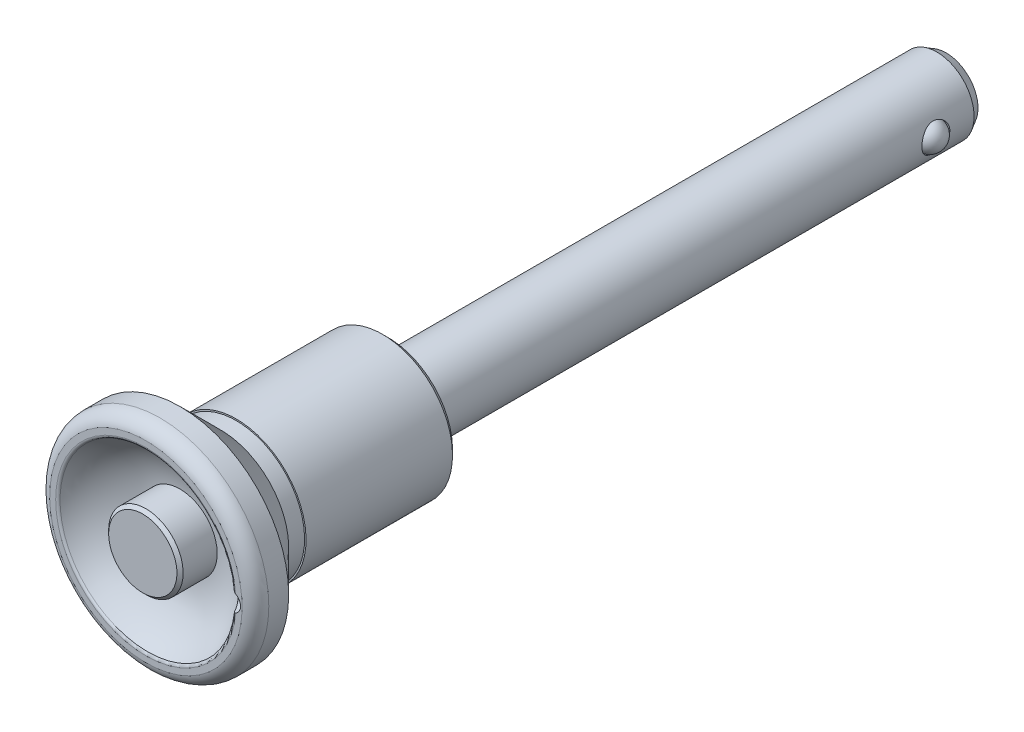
ISO-10303-21;
HEADER;
FILE_DESCRIPTION(('STEP AP214'),'2;1');
FILE_NAME('part.step','',(''),(''),'','','');
FILE_SCHEMA(('AUTOMOTIVE_DESIGN { 1 0 10303 214 1 1 1 1 }'));
ENDSEC;
DATA;
#1=APPLICATION_CONTEXT('core data for automotive mechanical design processes');
#2=APPLICATION_PROTOCOL_DEFINITION('international standard','automotive_design',2000,#1);
#3=PRODUCT_CONTEXT('',#1,'mechanical');
#4=PRODUCT('Part','Part','',(#3));
#5=PRODUCT_RELATED_PRODUCT_CATEGORY('part','',(#4));
#6=PRODUCT_DEFINITION_FORMATION('','',#4);
#7=PRODUCT_DEFINITION_CONTEXT('part definition',#1,'design');
#8=PRODUCT_DEFINITION('design','',#6,#7);
#9=PRODUCT_DEFINITION_SHAPE('','',#8);
#10=(LENGTH_UNIT() NAMED_UNIT(*) SI_UNIT(.MILLI.,.METRE.));
#11=(NAMED_UNIT(*) PLANE_ANGLE_UNIT() SI_UNIT($,.RADIAN.));
#12=(NAMED_UNIT(*) SI_UNIT($,.STERADIAN.) SOLID_ANGLE_UNIT());
#13=UNCERTAINTY_MEASURE_WITH_UNIT(LENGTH_MEASURE(1.E-05),#10,'distance_accuracy_value','');
#14=(GEOMETRIC_REPRESENTATION_CONTEXT(3) GLOBAL_UNCERTAINTY_ASSIGNED_CONTEXT((#13)) GLOBAL_UNIT_ASSIGNED_CONTEXT((#10,
#11,#12)) REPRESENTATION_CONTEXT('',''));
#15=CARTESIAN_POINT('',(0.,0.,0.));
#16=DIRECTION('',(0.,0.,1.));
#17=DIRECTION('',(1.,0.,0.));
#18=AXIS2_PLACEMENT_3D('',#15,#16,#17);
#19=CARTESIAN_POINT('',(0.,0.,-89.9));
#20=DIRECTION('',(0.,0.,-1.));
#21=DIRECTION('',(0.,1.,0.));
#22=AXIS2_PLACEMENT_3D('',#19,#20,#21);
#23=CYLINDRICAL_SURFACE('',#22,6.);
#24=CARTESIAN_POINT('',(-5.56214886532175,2.25,-82.25));
#25=CARTESIAN_POINT('',(-5.5621446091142,2.25000456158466,-82.1284887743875));
#26=CARTESIAN_POINT('',(-5.56617390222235,2.24012396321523,-82.0070076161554));
#27=CARTESIAN_POINT('',(-5.58174238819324,2.20104281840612,-81.7677078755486));
#28=CARTESIAN_POINT('',(-5.59328135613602,2.17184285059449,-81.6498891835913));
#29=CARTESIAN_POINT('',(-5.62238220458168,2.09534486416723,-81.4214369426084));
#30=CARTESIAN_POINT('',(-5.63992964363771,2.04809020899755,-81.3107869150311));
#31=CARTESIAN_POINT('',(-5.67904701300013,1.93697785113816,-81.0989421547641));
#32=CARTESIAN_POINT('',(-5.70061815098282,1.87311516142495,-80.9977502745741));
#33=CARTESIAN_POINT('',(-5.74655362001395,1.72719992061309,-80.802664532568));
#34=CARTESIAN_POINT('',(-5.77100012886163,1.64445571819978,-80.7093072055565));
#35=CARTESIAN_POINT('',(-5.81924625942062,1.46459375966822,-80.5374157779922));
#36=CARTESIAN_POINT('',(-5.84304574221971,1.36747294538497,-80.4588848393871));
#37=CARTESIAN_POINT('',(-5.88829310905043,1.15754198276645,-80.3162907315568));
#38=CARTESIAN_POINT('',(-5.90963341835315,1.04431042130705,-80.2528107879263));
#39=CARTESIAN_POINT('',(-5.94657011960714,0.807833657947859,-80.1460232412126));
#40=CARTESIAN_POINT('',(-5.96216850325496,0.684591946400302,-80.102708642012));
#41=CARTESIAN_POINT('',(-5.98528045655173,0.437234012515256,-80.0393631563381));
#42=CARTESIAN_POINT('',(-5.99311372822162,0.313384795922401,-80.0184085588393));
#43=CARTESIAN_POINT('',(-6.0009602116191,0.0636965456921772,-79.9974181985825));
#44=CARTESIAN_POINT('',(-6.00097596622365,-0.062141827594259,-79.9973756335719));
#45=CARTESIAN_POINT('',(-5.9933889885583,-0.305615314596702,-80.0176726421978));
#46=CARTESIAN_POINT('',(-5.9861631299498,-0.423348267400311,-80.0370039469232));
#47=CARTESIAN_POINT('',(-5.96539912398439,-0.653758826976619,-80.0938038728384));
#48=CARTESIAN_POINT('',(-5.95186052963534,-0.766436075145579,-80.1312737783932));
#49=CARTESIAN_POINT('',(-5.91956653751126,-0.985483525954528,-80.2237556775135));
#50=CARTESIAN_POINT('',(-5.90073809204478,-1.09173808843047,-80.2790150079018));
#51=CARTESIAN_POINT('',(-5.85976965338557,-1.29372991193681,-80.4052881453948));
#52=CARTESIAN_POINT('',(-5.83762859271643,-1.38946376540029,-80.4763070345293));
#53=CARTESIAN_POINT('',(-5.79078794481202,-1.5736357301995,-80.6369409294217));
#54=CARTESIAN_POINT('',(-5.76601445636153,-1.6613192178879,-80.727400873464));
#55=CARTESIAN_POINT('',(-5.71773690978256,-1.82055593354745,-80.921889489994));
#56=CARTESIAN_POINT('',(-5.69423317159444,-1.89210511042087,-81.0259215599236));
#57=CARTESIAN_POINT('',(-5.65069055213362,-2.01848417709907,-81.247579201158));
#58=CARTESIAN_POINT('',(-5.63074015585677,-2.07290771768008,-81.3654552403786));
#59=CARTESIAN_POINT('',(-5.59758657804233,-2.16084696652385,-81.6096443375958));
#60=CARTESIAN_POINT('',(-5.58437964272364,-2.19437430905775,-81.7359526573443));
#61=CARTESIAN_POINT('',(-5.56709395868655,-2.23785287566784,-81.9859639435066));
#62=CARTESIAN_POINT('',(-5.56255177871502,-2.24900281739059,-82.109426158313));
#63=CARTESIAN_POINT('',(-5.56179809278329,-2.25086828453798,-82.3565140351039));
#64=CARTESIAN_POINT('',(-5.56558450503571,-2.24158891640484,-82.4801396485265));
#65=CARTESIAN_POINT('',(-5.58059072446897,-2.20394600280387,-82.7178948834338));
#66=CARTESIAN_POINT('',(-5.59144914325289,-2.17650927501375,-82.8321967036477));
#67=CARTESIAN_POINT('',(-5.61894730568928,-2.10449661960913,-83.0545219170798));
#68=CARTESIAN_POINT('',(-5.63558823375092,-2.05991718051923,-83.1625440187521));
#69=CARTESIAN_POINT('',(-5.67354364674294,-1.95300438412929,-83.3737466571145));
#70=CARTESIAN_POINT('',(-5.69500993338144,-1.89006817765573,-83.4765939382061));
#71=CARTESIAN_POINT('',(-5.7399422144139,-1.74886976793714,-83.670693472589));
#72=CARTESIAN_POINT('',(-5.76340893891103,-1.6706019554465,-83.7619414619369));
#73=CARTESIAN_POINT('',(-5.8114956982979,-1.49509101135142,-83.9362525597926));
#74=CARTESIAN_POINT('',(-5.83609454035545,-1.39695951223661,-84.0184301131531));
#75=CARTESIAN_POINT('',(-5.88224812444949,-1.18769620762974,-84.1652575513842));
#76=CARTESIAN_POINT('',(-5.90380285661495,-1.07656435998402,-84.2299073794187));
#77=CARTESIAN_POINT('',(-5.94142478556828,-0.84452449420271,-84.3394190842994));
#78=CARTESIAN_POINT('',(-5.95751072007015,-0.72365164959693,-84.3843486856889));
#79=CARTESIAN_POINT('',(-5.98244155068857,-0.475322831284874,-84.4529846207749));
#80=CARTESIAN_POINT('',(-5.99128984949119,-0.34786998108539,-84.4767009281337));
#81=CARTESIAN_POINT('',(-6.0004261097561,-0.0980033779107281,-84.5011616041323));
#82=CARTESIAN_POINT('',(-6.00118291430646,0.0242711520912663,-84.5031642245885));
#83=CARTESIAN_POINT('',(-5.99527334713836,0.267340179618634,-84.4873772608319));
#84=CARTESIAN_POINT('',(-5.98860787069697,0.38813485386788,-84.4695900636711));
#85=CARTESIAN_POINT('',(-5.96881634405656,0.621822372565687,-84.4156117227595));
#86=CARTESIAN_POINT('',(-5.95585187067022,0.734836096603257,-84.3798801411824));
#87=CARTESIAN_POINT('',(-5.92481675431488,0.953273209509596,-84.2914849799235));
#88=CARTESIAN_POINT('',(-5.90674514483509,1.05869515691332,-84.2388181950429));
#89=CARTESIAN_POINT('',(-5.86635927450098,1.26381026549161,-84.1155290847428));
#90=CARTESIAN_POINT('',(-5.84389860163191,1.36307632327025,-84.0442450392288));
#91=CARTESIAN_POINT('',(-5.79749261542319,1.54862602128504,-83.8867882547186));
#92=CARTESIAN_POINT('',(-5.77354677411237,1.63490500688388,-83.8006102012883));
#93=CARTESIAN_POINT('',(-5.72532194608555,1.7967182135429,-83.6104038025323));
#94=CARTESIAN_POINT('',(-5.70109208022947,1.87144499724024,-83.5056733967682));
#95=CARTESIAN_POINT('',(-5.65647487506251,2.00227064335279,-83.2843761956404));
#96=CARTESIAN_POINT('',(-5.63608793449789,2.05836757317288,-83.1678081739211));
#97=CARTESIAN_POINT('',(-5.60103404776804,2.15198830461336,-82.9205664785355));
#98=CARTESIAN_POINT('',(-5.58665704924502,2.18859004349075,-82.7894984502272));
#99=CARTESIAN_POINT('',(-5.56721991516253,2.23758535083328,-82.5222720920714));
#100=CARTESIAN_POINT('',(-5.56215363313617,2.24999489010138,-82.3861171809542));
#101=CARTESIAN_POINT('',(-5.56214886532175,2.25,-82.25));
#102=B_SPLINE_CURVE_WITH_KNOTS('',3,(#24,#25,#26,#27,#28,#29,#30,#31,#32,#33,#34,#35,#36,#37,
#38,#39,#40,#41,#42,#43,#44,#45,#46,#47,#48,#49,#50,#51,#52,#53,#54,#55,#56,#57,#58,#59,#60,#61,
#62,#63,#64,#65,#66,#67,#68,#69,#70,#71,#72,#73,#74,#75,#76,#77,#78,#79,#80,#81,#82,#83,#84,#85,
#86,#87,#88,#89,#90,#91,#92,#93,#94,#95,#96,#97,#98,#99,#100,#101),.UNSPECIFIED.,.T.,.F.,(4,2,2,
2,2,2,2,2,2,2,2,2,2,2,2,2,2,2,2,2,2,2,2,2,2,2,2,2,2,2,2,2,2,2,2,2,2,2,4),(0.,0.364026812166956,
0.728042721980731,1.09118978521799,1.45444601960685,1.83411978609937,2.2138744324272,
2.60655108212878,2.99909139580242,3.37470027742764,3.75018698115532,4.10709709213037,
4.46403247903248,4.82616196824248,5.1884084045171,5.57185012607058,5.95538801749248,
6.34743888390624,6.73927127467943,7.10948486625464,7.47960593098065,7.83215768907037,
8.18478170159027,8.55062341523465,8.91659922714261,9.30577525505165,9.69495254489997,
10.0827826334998,10.4704302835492,10.8354858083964,11.2004973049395,11.5566041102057,
11.9127783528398,12.2839248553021,12.6552040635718,13.0460789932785,13.4369944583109,
13.8450476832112,14.2528314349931),.UNSPECIFIED.);
#103=CARTESIAN_POINT('',(-5.56214886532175,2.25,-82.25));
#104=VERTEX_POINT('',#103);
#105=EDGE_CURVE('E68',#104,#104,#102,.T.);
#106=ORIENTED_EDGE('',*,*,#105,.T.);
#107=EDGE_LOOP('',(#106));
#108=FACE_BOUND('',#107,.T.);
#109=CARTESIAN_POINT('',(0.,0.,-88.4));
#110=DIRECTION('',(0.,0.,-1.));
#111=DIRECTION('',(0.,1.,0.));
#112=AXIS2_PLACEMENT_3D('',#109,#110,#111);
#113=CIRCLE('',#112,6.);
#114=CARTESIAN_POINT('',(0.,6.,-88.4));
#115=VERTEX_POINT('',#114);
#116=EDGE_CURVE('E314',#115,#115,#113,.T.);
#117=ORIENTED_EDGE('',*,*,#116,.F.);
#118=EDGE_LOOP('',(#117));
#119=FACE_BOUND('',#118,.T.);
#120=CARTESIAN_POINT('',(5.56214886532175,2.25,-82.25));
#121=CARTESIAN_POINT('',(5.5621446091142,2.25000456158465,-82.3715112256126));
#122=CARTESIAN_POINT('',(5.56617390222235,2.24012396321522,-82.4929923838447));
#123=CARTESIAN_POINT('',(5.58174238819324,2.20104281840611,-82.7322921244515));
#124=CARTESIAN_POINT('',(5.59328135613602,2.1718428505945,-82.8501108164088));
#125=CARTESIAN_POINT('',(5.62238220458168,2.09534486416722,-83.0785630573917));
#126=CARTESIAN_POINT('',(5.63992964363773,2.04809020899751,-83.189213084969));
#127=CARTESIAN_POINT('',(5.67904701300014,1.93697785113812,-83.401057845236));
#128=CARTESIAN_POINT('',(5.70061815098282,1.87311516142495,-83.502249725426));
#129=CARTESIAN_POINT('',(5.74655362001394,1.7271999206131,-83.6973354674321));
#130=CARTESIAN_POINT('',(5.77100012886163,1.64445571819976,-83.7906927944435));
#131=CARTESIAN_POINT('',(5.81924625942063,1.46459375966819,-83.9625842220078));
#132=CARTESIAN_POINT('',(5.84304574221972,1.36747294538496,-84.0411151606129));
#133=CARTESIAN_POINT('',(5.88829310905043,1.15754198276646,-84.1837092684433));
#134=CARTESIAN_POINT('',(5.90963341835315,1.04431042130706,-84.2471892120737));
#135=CARTESIAN_POINT('',(5.94657011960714,0.807833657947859,-84.3539767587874));
#136=CARTESIAN_POINT('',(5.96216850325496,0.684591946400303,-84.397291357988));
#137=CARTESIAN_POINT('',(5.98528045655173,0.437234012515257,-84.4606368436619));
#138=CARTESIAN_POINT('',(5.99311372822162,0.313384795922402,-84.4815914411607));
#139=CARTESIAN_POINT('',(6.0009602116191,0.0636965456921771,-84.5025818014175));
#140=CARTESIAN_POINT('',(6.00097596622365,-0.0621418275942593,-84.5026243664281));
#141=CARTESIAN_POINT('',(5.9933889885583,-0.305615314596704,-84.4823273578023));
#142=CARTESIAN_POINT('',(5.9861631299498,-0.423348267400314,-84.4629960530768));
#143=CARTESIAN_POINT('',(5.96539912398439,-0.653758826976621,-84.4061961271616));
#144=CARTESIAN_POINT('',(5.95186052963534,-0.766436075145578,-84.3687262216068));
#145=CARTESIAN_POINT('',(5.91956653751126,-0.985483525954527,-84.2762443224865));
#146=CARTESIAN_POINT('',(5.90073809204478,-1.09173808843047,-84.2209849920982));
#147=CARTESIAN_POINT('',(5.85976965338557,-1.29372991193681,-84.0947118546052));
#148=CARTESIAN_POINT('',(5.83762859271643,-1.38946376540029,-84.0236929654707));
#149=CARTESIAN_POINT('',(5.79078794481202,-1.5736357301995,-83.8630590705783));
#150=CARTESIAN_POINT('',(5.76601445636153,-1.6613192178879,-83.772599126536));
#151=CARTESIAN_POINT('',(5.71773690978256,-1.82055593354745,-83.578110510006));
#152=CARTESIAN_POINT('',(5.69423317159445,-1.89210511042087,-83.4740784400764));
#153=CARTESIAN_POINT('',(5.65069055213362,-2.01848417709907,-83.252420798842));
#154=CARTESIAN_POINT('',(5.63074015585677,-2.07290771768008,-83.1345447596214));
#155=CARTESIAN_POINT('',(5.59758657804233,-2.16084696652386,-82.8903556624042));
#156=CARTESIAN_POINT('',(5.58437964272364,-2.19437430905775,-82.7640473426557));
#157=CARTESIAN_POINT('',(5.56709395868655,-2.23785287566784,-82.5140360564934));
#158=CARTESIAN_POINT('',(5.56255177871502,-2.24900281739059,-82.3905738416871));
#159=CARTESIAN_POINT('',(5.56179809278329,-2.25086828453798,-82.1434859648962));
#160=CARTESIAN_POINT('',(5.56558450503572,-2.24158891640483,-82.0198603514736));
#161=CARTESIAN_POINT('',(5.58059072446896,-2.20394600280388,-81.7821051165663));
#162=CARTESIAN_POINT('',(5.59144914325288,-2.17650927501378,-81.6678032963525));
#163=CARTESIAN_POINT('',(5.61894730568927,-2.10449661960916,-81.4454780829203));
#164=CARTESIAN_POINT('',(5.63558823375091,-2.05991718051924,-81.337455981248));
#165=CARTESIAN_POINT('',(5.67354364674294,-1.95300438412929,-81.1262533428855));
#166=CARTESIAN_POINT('',(5.69500993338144,-1.89006817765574,-81.023406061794));
#167=CARTESIAN_POINT('',(5.7399422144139,-1.74886976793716,-80.829306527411));
#168=CARTESIAN_POINT('',(5.76340893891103,-1.67060195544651,-80.7380585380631));
#169=CARTESIAN_POINT('',(5.8114956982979,-1.49509101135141,-80.5637474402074));
#170=CARTESIAN_POINT('',(5.83609454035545,-1.3969595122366,-80.4815698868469));
#171=CARTESIAN_POINT('',(5.88224812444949,-1.18769620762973,-80.3347424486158));
#172=CARTESIAN_POINT('',(5.90380285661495,-1.07656435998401,-80.2700926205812));
#173=CARTESIAN_POINT('',(5.94142478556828,-0.844524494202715,-80.1605809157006));
#174=CARTESIAN_POINT('',(5.95751072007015,-0.72365164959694,-80.1156513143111));
#175=CARTESIAN_POINT('',(5.98244155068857,-0.475322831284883,-80.0470153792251));
#176=CARTESIAN_POINT('',(5.99128984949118,-0.34786998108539,-80.0232990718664));
#177=CARTESIAN_POINT('',(6.0004261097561,-0.0980033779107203,-79.9988383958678));
#178=CARTESIAN_POINT('',(6.00118291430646,0.0242711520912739,-79.9968357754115));
#179=CARTESIAN_POINT('',(5.99527334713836,0.267340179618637,-80.0126227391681));
#180=CARTESIAN_POINT('',(5.98860787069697,0.38813485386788,-80.0304099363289));
#181=CARTESIAN_POINT('',(5.96881634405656,0.621822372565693,-80.0843882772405));
#182=CARTESIAN_POINT('',(5.95585187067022,0.734836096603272,-80.1201198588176));
#183=CARTESIAN_POINT('',(5.92481675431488,0.953273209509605,-80.2085150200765));
#184=CARTESIAN_POINT('',(5.90674514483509,1.05869515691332,-80.2611818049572));
#185=CARTESIAN_POINT('',(5.86635927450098,1.26381026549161,-80.3844709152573));
#186=CARTESIAN_POINT('',(5.8438986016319,1.36307632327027,-80.4557549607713));
#187=CARTESIAN_POINT('',(5.79749261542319,1.54862602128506,-80.6132117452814));
#188=CARTESIAN_POINT('',(5.77354677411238,1.63490500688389,-80.6993897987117));
#189=CARTESIAN_POINT('',(5.72532194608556,1.7967182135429,-80.8895961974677));
#190=CARTESIAN_POINT('',(5.70109208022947,1.87144499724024,-80.9943266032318));
#191=CARTESIAN_POINT('',(5.6564748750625,2.00227064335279,-81.2156238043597));
#192=CARTESIAN_POINT('',(5.63608793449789,2.05836757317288,-81.3321918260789));
#193=CARTESIAN_POINT('',(5.60103404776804,2.15198830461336,-81.5794335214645));
#194=CARTESIAN_POINT('',(5.58665704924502,2.18859004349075,-81.7105015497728));
#195=CARTESIAN_POINT('',(5.56721991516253,2.23758535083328,-81.9777279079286));
#196=CARTESIAN_POINT('',(5.56215363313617,2.24999489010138,-82.1138828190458));
#197=CARTESIAN_POINT('',(5.56214886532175,2.25,-82.25));
#198=B_SPLINE_CURVE_WITH_KNOTS('',3,(#120,#121,#122,#123,#124,#125,#126,#127,#128,#129,#130,
#131,#132,#133,#134,#135,#136,#137,#138,#139,#140,#141,#142,#143,#144,#145,#146,#147,#148,#149,
#150,#151,#152,#153,#154,#155,#156,#157,#158,#159,#160,#161,#162,#163,#164,#165,#166,#167,#168,
#169,#170,#171,#172,#173,#174,#175,#176,#177,#178,#179,#180,#181,#182,#183,#184,#185,#186,#187,
#188,#189,#190,#191,#192,#193,#194,#195,#196,#197),.UNSPECIFIED.,.T.,.F.,(4,2,2,2,2,2,2,2,2,2,2,
2,2,2,2,2,2,2,2,2,2,2,2,2,2,2,2,2,2,2,2,2,2,2,2,2,2,2,4),(0.,0.364026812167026,
0.728042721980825,1.09118978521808,1.45444601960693,1.83411978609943,2.21387443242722,
2.60655108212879,2.99909139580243,3.37470027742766,3.75018698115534,4.10709709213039,
4.4640324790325,4.82616196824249,5.18840840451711,5.5718501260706,5.95538801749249,
6.34743888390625,6.73927127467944,7.10948486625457,7.47960593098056,7.83215768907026,
8.1847817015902,8.55062341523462,8.91659922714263,9.30577525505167,9.69495254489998,
10.0827826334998,10.4704302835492,10.8354858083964,11.2004973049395,11.5566041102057,
11.9127783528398,12.2839248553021,12.6552040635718,13.0460789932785,13.4369944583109,
13.8450476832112,14.2528314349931),.UNSPECIFIED.);
#199=CARTESIAN_POINT('',(5.56214886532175,2.25,-82.25));
#200=VERTEX_POINT('',#199);
#201=EDGE_CURVE('E292',#200,#200,#198,.T.);
#202=ORIENTED_EDGE('',*,*,#201,.T.);
#203=EDGE_LOOP('',(#202));
#204=FACE_BOUND('',#203,.T.);
#205=CARTESIAN_POINT('',(0.,0.,0.));
#206=DIRECTION('',(0.,0.,1.));
#207=DIRECTION('',(1.,0.,0.));
#208=AXIS2_PLACEMENT_3D('',#205,#206,#207);
#209=CIRCLE('',#208,6.);
#210=CARTESIAN_POINT('',(6.,0.,0.));
#211=VERTEX_POINT('',#210);
#212=EDGE_CURVE('E80',#211,#211,#209,.T.);
#213=ORIENTED_EDGE('',*,*,#212,.F.);
#214=EDGE_LOOP('',(#213));
#215=FACE_BOUND('',#214,.T.);
#216=ADVANCED_FACE('F14',(#108,#119,#204,#215),#23,.T.);
#217=CARTESIAN_POINT('',(0.,0.,-89.9));
#218=DIRECTION('',(0.,0.,-1.));
#219=DIRECTION('',(0.,1.,0.));
#220=AXIS2_PLACEMENT_3D('',#217,#218,#219);
#221=CYLINDRICAL_SURFACE('',#220,2.75);
#222=CARTESIAN_POINT('',(0.,0.,-84.5));
#223=DIRECTION('',(0.,0.,-1.));
#224=DIRECTION('',(0.,1.,0.));
#225=AXIS2_PLACEMENT_3D('',#222,#223,#224);
#226=CIRCLE('',#225,2.75);
#227=CARTESIAN_POINT('',(0.,2.75,-84.5));
#228=VERTEX_POINT('',#227);
#229=EDGE_CURVE('E74',#228,#228,#226,.T.);
#230=ORIENTED_EDGE('',*,*,#229,.F.);
#231=EDGE_LOOP('',(#230));
#232=FACE_BOUND('',#231,.T.);
#233=CARTESIAN_POINT('',(0.,0.,-89.9));
#234=DIRECTION('',(0.,0.,-1.));
#235=DIRECTION('',(0.,1.,0.));
#236=AXIS2_PLACEMENT_3D('',#233,#234,#235);
#237=CIRCLE('',#236,2.75);
#238=CARTESIAN_POINT('',(0.,2.75,-89.9));
#239=VERTEX_POINT('',#238);
#240=EDGE_CURVE('E306',#239,#239,#237,.T.);
#241=ORIENTED_EDGE('',*,*,#240,.T.);
#242=EDGE_LOOP('',(#241));
#243=FACE_BOUND('',#242,.T.);
#244=ADVANCED_FACE('F273',(#232,#243),#221,.F.);
#245=CARTESIAN_POINT('',(2.75,0.,-89.9));
#246=DIRECTION('',(0.,0.,-1.));
#247=DIRECTION('',(0.,1.,0.));
#248=AXIS2_PLACEMENT_3D('',#245,#246,#247);
#249=PLANE('',#248);
#250=CARTESIAN_POINT('',(0.,0.,-89.9));
#251=DIRECTION('',(0.,0.,-1.));
#252=DIRECTION('',(0.,1.,0.));
#253=AXIS2_PLACEMENT_3D('',#250,#251,#252);
#254=CIRCLE('',#253,5.13397459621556);
#255=CARTESIAN_POINT('',(0.,5.13397459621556,-89.9));
#256=VERTEX_POINT('',#255);
#257=EDGE_CURVE('E310',#256,#256,#254,.T.);
#258=ORIENTED_EDGE('',*,*,#257,.T.);
#259=EDGE_LOOP('',(#258));
#260=FACE_BOUND('',#259,.T.);
#261=ORIENTED_EDGE('',*,*,#240,.F.);
#262=EDGE_LOOP('',(#261));
#263=FACE_BOUND('',#262,.T.);
#264=ADVANCED_FACE('F280',(#260,#263),#249,.T.);
#265=CARTESIAN_POINT('',(0.,0.,-89.9));
#266=DIRECTION('',(0.,0.,1.));
#267=DIRECTION('',(0.,-1.,0.));
#268=AXIS2_PLACEMENT_3D('',#265,#266,#267);
#269=CONICAL_SURFACE('',#268,5.13397459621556,0.523598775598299);
#270=ORIENTED_EDGE('',*,*,#116,.T.);
#271=EDGE_LOOP('',(#270));
#272=FACE_BOUND('',#271,.T.);
#273=ORIENTED_EDGE('',*,*,#257,.F.);
#274=EDGE_LOOP('',(#273));
#275=FACE_BOUND('',#274,.T.);
#276=ADVANCED_FACE('F288',(#272,#275),#269,.T.);
#277=CARTESIAN_POINT('',(7.,0.,-82.25));
#278=DIRECTION('',(1.,0.,0.));
#279=DIRECTION('',(0.,1.,0.));
#280=AXIS2_PLACEMENT_3D('',#277,#278,#279);
#281=CYLINDRICAL_SURFACE('',#280,2.25);
#282=CARTESIAN_POINT('',(4.70120856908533,2.25,-82.25));
#283=CARTESIAN_POINT('',(4.70121469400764,2.24999417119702,-82.1304590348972));
#284=CARTESIAN_POINT('',(4.70583400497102,2.24041261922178,-82.0107125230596));
#285=CARTESIAN_POINT('',(4.72369711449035,2.20249080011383,-81.7747180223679));
#286=CARTESIAN_POINT('',(4.73696351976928,2.17410135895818,-81.6584800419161));
#287=CARTESIAN_POINT('',(4.77031963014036,2.09989154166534,-81.4333349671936));
#288=CARTESIAN_POINT('',(4.79038009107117,2.05414577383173,-81.3243988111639));
#289=CARTESIAN_POINT('',(4.83501981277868,1.94674472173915,-81.1157771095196));
#290=CARTESIAN_POINT('',(4.85959823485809,1.88509238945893,-81.016089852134));
#291=CARTESIAN_POINT('',(4.91234222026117,1.7432193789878,-80.8220680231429));
#292=CARTESIAN_POINT('',(4.94063496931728,1.66209866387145,-80.7284258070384));
#293=CARTESIAN_POINT('',(4.99657815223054,1.485478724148,-80.5555585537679));
#294=CARTESIAN_POINT('',(5.02422832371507,1.38997374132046,-80.4763393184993));
#295=CARTESIAN_POINT('',(5.07733633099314,1.18176930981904,-80.3309420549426));
#296=CARTESIAN_POINT('',(5.10262925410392,1.06847133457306,-80.2655553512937));
#297=CARTESIAN_POINT('',(5.14660113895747,0.831192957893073,-80.1550726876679));
#298=CARTESIAN_POINT('',(5.16528324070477,0.707217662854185,-80.1099670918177));
#299=CARTESIAN_POINT('',(5.1930243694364,0.459385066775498,-80.0438746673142));
#300=CARTESIAN_POINT('',(5.20255899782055,0.335901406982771,-80.0216905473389));
#301=CARTESIAN_POINT('',(5.21266651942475,0.0866213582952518,-79.9981895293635));
#302=CARTESIAN_POINT('',(5.21324333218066,-0.0391739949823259,-79.9968635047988));
#303=CARTESIAN_POINT('',(5.20564133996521,-0.280752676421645,-80.0145162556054));
#304=CARTESIAN_POINT('',(5.19803132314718,-0.396653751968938,-80.0321759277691));
#305=CARTESIAN_POINT('',(5.17570524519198,-0.623658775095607,-80.0850210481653));
#306=CARTESIAN_POINT('',(5.16098865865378,-0.734762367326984,-80.1202077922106));
#307=CARTESIAN_POINT('',(5.12557562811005,-0.951074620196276,-80.2075078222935));
#308=CARTESIAN_POINT('',(5.10479112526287,-1.05616705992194,-80.2598718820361));
#309=CARTESIAN_POINT('',(5.05924909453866,-1.25634985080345,-80.3797828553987));
#310=CARTESIAN_POINT('',(5.03449013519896,-1.35143657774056,-80.4473352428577));
#311=CARTESIAN_POINT('',(4.9812692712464,-1.53647964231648,-80.6015757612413));
#312=CARTESIAN_POINT('',(4.95266891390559,-1.62551877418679,-80.689317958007));
#313=CARTESIAN_POINT('',(4.89634671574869,-1.78803350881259,-80.878505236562));
#314=CARTESIAN_POINT('',(4.8686252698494,-1.86150219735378,-80.9799563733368));
#315=CARTESIAN_POINT('',(4.81616806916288,-1.99339518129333,-81.1984520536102));
#316=CARTESIAN_POINT('',(4.79158303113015,-2.05115292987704,-81.3159383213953));
#317=CARTESIAN_POINT('',(4.75001097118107,-2.14568300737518,-81.5603104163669));
#318=CARTESIAN_POINT('',(4.73301805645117,-2.18247161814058,-81.6871888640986));
#319=CARTESIAN_POINT('',(4.7100473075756,-2.2315930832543,-81.9375319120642));
#320=CARTESIAN_POINT('',(4.70339790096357,-2.24542132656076,-82.0606401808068));
#321=CARTESIAN_POINT('',(4.69994279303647,-2.25264846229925,-82.3075714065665));
#322=CARTESIAN_POINT('',(4.70313324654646,-2.24605533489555,-82.431394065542));
#323=CARTESIAN_POINT('',(4.71830050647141,-2.21399394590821,-82.6669653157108));
#324=CARTESIAN_POINT('',(4.72963794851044,-2.18989787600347,-82.778947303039));
#325=CARTESIAN_POINT('',(4.75898261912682,-2.12536894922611,-82.9971687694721));
#326=CARTESIAN_POINT('',(4.77699148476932,-2.08493208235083,-83.1034068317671));
#327=CARTESIAN_POINT('',(4.81860535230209,-1.98691927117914,-83.3123309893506));
#328=CARTESIAN_POINT('',(4.84242072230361,-1.92867086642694,-83.414658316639));
#329=CARTESIAN_POINT('',(4.89268495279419,-1.79734114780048,-83.6086003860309));
#330=CARTESIAN_POINT('',(4.91913500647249,-1.72425309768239,-83.7002102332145));
#331=CARTESIAN_POINT('',(4.97451487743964,-1.5576964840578,-83.8785741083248));
#332=CARTESIAN_POINT('',(5.00345675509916,-1.46299589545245,-83.9641786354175));
#333=CARTESIAN_POINT('',(5.05840859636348,-1.25992784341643,-84.11851397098));
#334=CARTESIAN_POINT('',(5.0844182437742,-1.15155890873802,-84.1872429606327));
#335=CARTESIAN_POINT('',(5.13083610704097,-0.923055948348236,-84.3059980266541));
#336=CARTESIAN_POINT('',(5.15121223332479,-0.802859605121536,-84.3559175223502));
#337=CARTESIAN_POINT('',(5.18380508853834,-0.554662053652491,-84.4344361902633));
#338=CARTESIAN_POINT('',(5.19602706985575,-0.4266659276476,-84.4630490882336));
#339=CARTESIAN_POINT('',(5.21029045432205,-0.176736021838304,-84.4963229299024));
#340=CARTESIAN_POINT('',(5.21301888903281,-0.0550554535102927,-84.5026010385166));
#341=CARTESIAN_POINT('',(5.20993078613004,0.187600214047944,-84.495446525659));
#342=CARTESIAN_POINT('',(5.2041159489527,0.308575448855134,-84.4820178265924));
#343=CARTESIAN_POINT('',(5.18496872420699,0.541359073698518,-84.4369904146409));
#344=CARTESIAN_POINT('',(5.17194743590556,0.653340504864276,-84.4061426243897));
#345=CARTESIAN_POINT('',(5.13986314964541,0.870473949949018,-84.3280030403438));
#346=CARTESIAN_POINT('',(5.12079904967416,0.975624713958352,-84.2807082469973));
#347=CARTESIAN_POINT('',(5.07736891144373,1.18141977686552,-84.1686191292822));
#348=CARTESIAN_POINT('',(5.05280038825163,1.2816385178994,-84.1031238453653));
#349=CARTESIAN_POINT('',(5.00122306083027,1.47009921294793,-83.957485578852));
#350=CARTESIAN_POINT('',(4.9742132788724,1.5583363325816,-83.877336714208));
#351=CARTESIAN_POINT('',(4.9182708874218,1.72712341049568,-83.6976966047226));
#352=CARTESIAN_POINT('',(4.88934356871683,1.80662459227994,-83.5972140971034));
#353=CARTESIAN_POINT('',(4.83482876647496,1.94782882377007,-83.3835276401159));
#354=CARTESIAN_POINT('',(4.80924325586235,2.00952138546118,-83.270316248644));
#355=CARTESIAN_POINT('',(4.76470338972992,2.11297708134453,-83.0338474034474));
#356=CARTESIAN_POINT('',(4.74574393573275,2.15475554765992,-82.9105977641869));
#357=CARTESIAN_POINT('',(4.72435108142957,2.20105394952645,-82.7212685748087));
#358=CARTESIAN_POINT('',(4.71839681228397,2.21375426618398,-82.6574783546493));
#359=CARTESIAN_POINT('',(4.70903769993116,2.23359624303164,-82.5288695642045));
#360=CARTESIAN_POINT('',(4.70563091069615,2.24074214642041,-82.4640518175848));
#361=CARTESIAN_POINT('',(4.7027842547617,2.24670526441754,-82.3742341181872));
#362=CARTESIAN_POINT('',(4.70219412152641,2.24794009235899,-82.349407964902));
#363=CARTESIAN_POINT('',(4.70140563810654,2.24958807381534,-82.2997241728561));
#364=CARTESIAN_POINT('',(4.70120729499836,2.25000121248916,-82.2748665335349));
#365=CARTESIAN_POINT('',(4.70120856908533,2.25,-82.25));
#366=B_SPLINE_CURVE_WITH_KNOTS('',3,(#282,#283,#284,#285,#286,#287,#288,#289,#290,#291,#292,
#293,#294,#295,#296,#297,#298,#299,#300,#301,#302,#303,#304,#305,#306,#307,#308,#309,#310,#311,
#312,#313,#314,#315,#316,#317,#318,#319,#320,#321,#322,#323,#324,#325,#326,#327,#328,#329,#330,
#331,#332,#333,#334,#335,#336,#337,#338,#339,#340,#341,#342,#343,#344,#345,#346,#347,#348,#349,
#350,#351,#352,#353,#354,#355,#356,#357,#358,#359,#360,#361,#362,#363,#364,#365),.UNSPECIFIED.,
.T.,.F.,(4,2,2,2,2,2,2,2,2,2,2,2,2,2,2,2,2,2,2,2,2,2,2,2,2,2,2,2,2,2,2,2,2,2,2,2,2,2,2,2,2,4),
(0.,0.358523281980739,0.717987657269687,1.07592402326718,1.43379401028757,1.81338979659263,
2.19313794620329,2.59079710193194,2.98826712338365,3.36372670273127,3.73902199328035,
4.08983186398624,4.44066767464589,4.79687203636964,5.15320497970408,5.53621810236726,
5.9194009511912,6.3169357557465,6.71416146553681,7.08432459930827,7.45434310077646,
7.79811230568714,8.14196592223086,8.50086375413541,8.85992486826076,9.25080120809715,
9.64171965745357,10.0348210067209,10.427668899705,10.7914180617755,11.1550948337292,
11.5041747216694,11.8533183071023,12.2184179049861,12.583664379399,12.9758816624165,
13.3683294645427,13.7604746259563,13.9561801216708,14.1517359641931,14.2263134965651,
14.3008923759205),.UNSPECIFIED.);
#367=CARTESIAN_POINT('',(4.84677342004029,1.91641577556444,-83.4289192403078));
#368=VERTEX_POINT('',#367);
#369=CARTESIAN_POINT('',(4.84677342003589,-1.91641577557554,-83.4289192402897));
#370=VERTEX_POINT('',#369);
#371=EDGE_CURVE('E70',#368,#370,#366,.T.);
#372=ORIENTED_EDGE('',*,*,#371,.F.);
#373=CARTESIAN_POINT('',(5.21189620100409,0.,-84.5));
#374=CARTESIAN_POINT('',(5.21189615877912,0.126284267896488,-84.4999948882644));
#375=CARTESIAN_POINT('',(5.21139467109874,0.252644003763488,-84.4893340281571));
#376=CARTESIAN_POINT('',(5.2093805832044,0.501864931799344,-84.4469613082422));
#377=CARTESIAN_POINT('',(5.20786696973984,0.624722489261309,-84.4152283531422));
#378=CARTESIAN_POINT('',(5.20380519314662,0.863320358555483,-84.3316208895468));
#379=CARTESIAN_POINT('',(5.20125743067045,0.979063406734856,-84.2797541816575));
#380=CARTESIAN_POINT('',(5.19508229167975,1.20015943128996,-84.1573752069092));
#381=CARTESIAN_POINT('',(5.19145518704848,1.30551501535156,-84.0868676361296));
#382=CARTESIAN_POINT('',(5.18303472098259,1.50291352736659,-83.9291996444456));
#383=CARTESIAN_POINT('',(5.17824107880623,1.59495324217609,-83.8420352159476));
#384=CARTESIAN_POINT('',(5.16733442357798,1.76311423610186,-83.653525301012));
#385=CARTESIAN_POINT('',(5.1612210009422,1.83923055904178,-83.5521754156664));
#386=CARTESIAN_POINT('',(5.14734400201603,1.97343552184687,-83.3381336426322));
#387=CARTESIAN_POINT('',(5.13957863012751,2.03150437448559,-83.2254294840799));
#388=CARTESIAN_POINT('',(5.12176723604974,2.12782849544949,-82.9921124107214));
#389=CARTESIAN_POINT('',(5.11172400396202,2.1661078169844,-82.8715092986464));
#390=CARTESIAN_POINT('',(5.09330546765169,2.20774061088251,-82.6884429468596));
#391=CARTESIAN_POINT('',(5.08666779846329,2.21896106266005,-82.6275162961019));
#392=CARTESIAN_POINT('',(5.07117135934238,2.23631965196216,-82.5053136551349));
#393=CARTESIAN_POINT('',(5.06231462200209,2.24246241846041,-82.4440380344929));
#394=CARTESIAN_POINT('',(5.04473959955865,2.24786649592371,-82.3524947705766));
#395=CARTESIAN_POINT('',(5.03817832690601,2.24903385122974,-82.322083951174));
#396=CARTESIAN_POINT('',(5.02487846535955,2.24972982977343,-82.2856268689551));
#397=CARTESIAN_POINT('',(5.02196282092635,2.24983087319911,-82.2784116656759));
#398=CARTESIAN_POINT('',(5.01679668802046,2.24992122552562,-82.2690075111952));
#399=CARTESIAN_POINT('',(5.01524668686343,2.24994100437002,-82.2664653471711));
#400=CARTESIAN_POINT('',(5.01258312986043,2.24996347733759,-82.2628773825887));
#401=CARTESIAN_POINT('',(5.01163231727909,2.24996978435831,-82.2617128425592));
#402=CARTESIAN_POINT('',(5.00957474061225,2.24998007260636,-82.2595306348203));
#403=CARTESIAN_POINT('',(5.00846878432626,2.24998406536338,-82.258512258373));
#404=CARTESIAN_POINT('',(5.0067156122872,2.2499883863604,-82.2572404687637));
#405=CARTESIAN_POINT('',(5.00615104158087,2.2499895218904,-82.2568745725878));
#406=CARTESIAN_POINT('',(5.00497729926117,2.2499914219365,-82.2562214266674));
#407=CARTESIAN_POINT('',(5.00436814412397,2.24999218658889,-82.255934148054));
#408=CARTESIAN_POINT('',(5.00310140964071,2.24999338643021,-82.2554607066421));
#409=CARTESIAN_POINT('',(5.00244330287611,2.24999381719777,-82.2552759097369));
#410=CARTESIAN_POINT('',(5.0011038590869,2.24999436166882,-82.2550386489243));
#411=CARTESIAN_POINT('',(5.00042256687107,2.24999447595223,-82.2549859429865));
#412=CARTESIAN_POINT('',(4.99914424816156,2.24999440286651,-82.2550185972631));
#413=CARTESIAN_POINT('',(4.99854676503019,2.24999424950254,-82.2550883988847));
#414=CARTESIAN_POINT('',(4.99737209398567,2.24999369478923,-82.2553279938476));
#415=CARTESIAN_POINT('',(4.99679493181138,2.24999329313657,-82.2554979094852));
#416=CARTESIAN_POINT('',(4.99546550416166,2.24999202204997,-82.255998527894));
#417=CARTESIAN_POINT('',(4.99472705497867,2.24999103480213,-82.256365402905));
#418=CARTESIAN_POINT('',(4.99331619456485,2.24998849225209,-82.2572086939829));
#419=CARTESIAN_POINT('',(4.99264394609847,2.24998693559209,-82.257685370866));
#420=CARTESIAN_POINT('',(4.9907978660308,2.24998155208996,-82.2591607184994));
#421=CARTESIAN_POINT('',(4.98969889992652,2.24997693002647,-82.2602516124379));
#422=CARTESIAN_POINT('',(4.98765562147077,2.24996520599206,-82.2625688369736));
#423=CARTESIAN_POINT('',(4.98671188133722,2.249958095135,-82.2637956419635));
#424=CARTESIAN_POINT('',(4.98193653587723,2.2499128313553,-82.2705312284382));
#425=CARTESIAN_POINT('',(4.97899990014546,2.24985038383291,-82.2766418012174));
#426=CARTESIAN_POINT('',(4.97376920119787,2.24966896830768,-82.2891278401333));
#427=CARTESIAN_POINT('',(4.97148201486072,2.24954942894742,-82.2955053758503));
#428=CARTESIAN_POINT('',(4.96106149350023,2.24881762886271,-82.3271058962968));
#429=CARTESIAN_POINT('',(4.95530816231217,2.24778447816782,-82.3531043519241));
#430=CARTESIAN_POINT('',(4.94501184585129,2.24479018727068,-82.4053004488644));
#431=CARTESIAN_POINT('',(4.94047527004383,2.24282427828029,-82.4314984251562));
#432=CARTESIAN_POINT('',(4.927984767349,2.23550007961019,-82.5104298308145));
#433=CARTESIAN_POINT('',(4.92120435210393,2.22872063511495,-82.5632520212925));
#434=CARTESIAN_POINT('',(4.90891131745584,2.21142389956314,-82.6682645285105));
#435=CARTESIAN_POINT('',(4.90339617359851,2.20091415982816,-82.7204559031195));
#436=CARTESIAN_POINT('',(4.88803764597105,2.16373012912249,-82.8762327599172));
#437=CARTESIAN_POINT('',(4.87942579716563,2.13143364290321,-82.9786677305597));
#438=CARTESIAN_POINT('',(4.86395279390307,2.05263870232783,-83.1776953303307));
#439=CARTESIAN_POINT('',(4.85708717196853,2.00617717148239,-83.2743023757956));
#440=CARTESIAN_POINT('',(4.84463430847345,1.89998698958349,-83.4599495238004));
#441=CARTESIAN_POINT('',(4.83904642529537,1.84026502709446,-83.5489934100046));
#442=CARTESIAN_POINT('',(4.82796886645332,1.69683921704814,-83.7329593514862));
#443=CARTESIAN_POINT('',(4.82267830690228,1.61075316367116,-83.8260495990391));
#444=CARTESIAN_POINT('',(4.81331124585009,1.42411005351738,-83.9965405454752));
#445=CARTESIAN_POINT('',(4.80923548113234,1.32354426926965,-84.0739317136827));
#446=CARTESIAN_POINT('',(4.80219403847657,1.11084101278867,-84.2107437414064));
#447=CARTESIAN_POINT('',(4.79922814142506,0.998705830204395,-84.270168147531));
#448=CARTESIAN_POINT('',(4.79434733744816,0.766047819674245,-84.3693541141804));
#449=CARTESIAN_POINT('',(4.7924323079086,0.645525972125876,-84.4091179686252));
#450=CARTESIAN_POINT('',(4.78962227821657,0.399571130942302,-84.4678412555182));
#451=CARTESIAN_POINT('',(4.78872674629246,0.27414073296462,-84.4868115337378));
#452=CARTESIAN_POINT('',(4.78794106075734,0.0218703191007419,-84.5034420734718));
#453=CARTESIAN_POINT('',(4.78805091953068,-0.104969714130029,-84.5011020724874));
#454=CARTESIAN_POINT('',(4.78927737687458,-0.356418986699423,-84.4751821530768));
#455=CARTESIAN_POINT('',(4.79039368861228,-0.481028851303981,-84.4516082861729));
#456=CARTESIAN_POINT('',(4.79364906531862,-0.724519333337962,-84.3839024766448));
#457=CARTESIAN_POINT('',(4.79578813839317,-0.843399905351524,-84.339770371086));
#458=CARTESIAN_POINT('',(4.80112512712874,-1.0720730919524,-84.2322025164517));
#459=CARTESIAN_POINT('',(4.80432317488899,-1.18186457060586,-84.1687643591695));
#460=CARTESIAN_POINT('',(4.81184515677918,-1.38922597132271,-84.0244041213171));
#461=CARTESIAN_POINT('',(4.81616903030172,-1.48679655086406,-83.9434829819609));
#462=CARTESIAN_POINT('',(4.82606445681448,-1.66699500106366,-83.7664389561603));
#463=CARTESIAN_POINT('',(4.83163644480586,-1.74961764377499,-83.6703107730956));
#464=CARTESIAN_POINT('',(4.84427017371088,-1.89756793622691,-83.465602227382));
#465=CARTESIAN_POINT('',(4.85133233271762,-1.96289072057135,-83.3570183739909));
#466=CARTESIAN_POINT('',(4.86742332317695,-2.07443577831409,-83.1304409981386));
#467=CARTESIAN_POINT('',(4.87645418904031,-2.12063814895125,-83.0124378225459));
#468=CARTESIAN_POINT('',(4.89787609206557,-2.19253624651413,-82.7707327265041));
#469=CARTESIAN_POINT('',(4.9102638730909,-2.2182517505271,-82.6470364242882));
#470=CARTESIAN_POINT('',(4.93489152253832,-2.24079197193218,-82.4621887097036));
#471=CARTESIAN_POINT('',(4.9439209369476,-2.24567525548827,-82.4016395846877));
#472=CARTESIAN_POINT('',(4.96144377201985,-2.24865520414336,-82.3288938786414));
#473=CARTESIAN_POINT('',(4.96488235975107,-2.24907569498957,-82.3157504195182));
#474=CARTESIAN_POINT('',(4.97117438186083,-2.24953233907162,-82.2963421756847));
#475=CARTESIAN_POINT('',(4.97347535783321,-2.24965571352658,-82.2898919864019));
#476=CARTESIAN_POINT('',(4.97872381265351,-2.2498436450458,-82.277231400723));
#477=CARTESIAN_POINT('',(4.98166680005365,-2.24990859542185,-82.2710196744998));
#478=CARTESIAN_POINT('',(4.98649447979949,-2.24995636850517,-82.264083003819));
#479=CARTESIAN_POINT('',(4.98748893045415,-2.24996411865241,-82.2627698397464));
#480=CARTESIAN_POINT('',(4.98964936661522,-2.24997676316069,-82.2602966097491));
#481=CARTESIAN_POINT('',(4.99081420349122,-2.24998167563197,-82.2591356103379));
#482=CARTESIAN_POINT('',(4.99264559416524,-2.24998690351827,-82.2576897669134));
#483=CARTESIAN_POINT('',(4.99321543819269,-2.24998824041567,-82.2572839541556));
#484=CARTESIAN_POINT('',(4.99440370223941,-2.24999050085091,-82.2565481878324));
#485=CARTESIAN_POINT('',(4.99502214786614,-2.24999142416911,-82.2562182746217));
#486=CARTESIAN_POINT('',(4.99631433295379,-2.24999290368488,-82.2556581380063));
#487=CARTESIAN_POINT('',(4.99698872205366,-2.24999345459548,-82.2554293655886));
#488=CARTESIAN_POINT('',(4.99836895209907,-2.24999420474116,-82.2551094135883));
#489=CARTESIAN_POINT('',(4.99907470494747,-2.24999440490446,-82.2550178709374));
#490=CARTESIAN_POINT('',(5.00040115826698,-2.24999446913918,-82.2549888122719));
#491=CARTESIAN_POINT('',(5.00102150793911,-2.24999437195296,-82.2550335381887));
#492=CARTESIAN_POINT('',(5.00224443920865,-2.24999391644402,-82.2552331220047));
#493=CARTESIAN_POINT('',(5.00284699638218,-2.24999355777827,-82.2553881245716));
#494=CARTESIAN_POINT('',(5.00417868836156,-2.24999242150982,-82.255845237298));
#495=CARTESIAN_POINT('',(5.0048978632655,-2.24999155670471,-82.2561758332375));
#496=CARTESIAN_POINT('',(5.00627531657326,-2.24998931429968,-82.2569451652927));
#497=CARTESIAN_POINT('',(5.0069334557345,-2.24998793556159,-82.2573841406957));
#498=CARTESIAN_POINT('',(5.00870837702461,-2.24998324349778,-82.2587256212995));
#499=CARTESIAN_POINT('',(5.00975965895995,-2.24997927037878,-82.2597134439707));
#500=CARTESIAN_POINT('',(5.01171957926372,-2.24996920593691,-82.2618205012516));
#501=CARTESIAN_POINT('',(5.01262772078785,-2.24996310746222,-82.2629401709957));
#502=CARTESIAN_POINT('',(5.01640763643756,-2.2499311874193,-82.2680200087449));
#503=CARTESIAN_POINT('',(5.01876364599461,-2.24989314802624,-82.2723506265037));
#504=CARTESIAN_POINT('',(5.02299212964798,-2.24978775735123,-82.2812382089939));
#505=CARTESIAN_POINT('',(5.02486105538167,-2.24972020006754,-82.2857965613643));
#506=CARTESIAN_POINT('',(5.03489036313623,-2.24924415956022,-82.3122210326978));
#507=CARTESIAN_POINT('',(5.04042841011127,-2.24850580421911,-82.3350346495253));
#508=CARTESIAN_POINT('',(5.05033017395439,-2.24631053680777,-82.3808965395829));
#509=CARTESIAN_POINT('',(5.05468563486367,-2.24484876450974,-82.4039453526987));
#510=CARTESIAN_POINT('',(5.06660405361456,-2.2393744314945,-82.4732312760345));
#511=CARTESIAN_POINT('',(5.07302100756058,-2.23427272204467,-82.5196160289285));
#512=CARTESIAN_POINT('',(5.08465584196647,-2.22118976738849,-82.6119328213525));
#513=CARTESIAN_POINT('',(5.08987723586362,-2.21321714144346,-82.6578657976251));
#514=CARTESIAN_POINT('',(5.10441457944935,-2.1849605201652,-82.7951352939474));
#515=CARTESIAN_POINT('',(5.11257661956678,-2.16035336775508,-82.8857441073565));
#516=CARTESIAN_POINT('',(5.12987991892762,-2.0895877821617,-83.093794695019));
#517=CARTESIAN_POINT('',(5.13839608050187,-2.03893154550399,-83.2097746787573));
#518=CARTESIAN_POINT('',(5.15359757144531,-1.91883883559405,-83.4317326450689));
#519=CARTESIAN_POINT('',(5.16028217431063,-1.84939493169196,-83.5377066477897));
#520=CARTESIAN_POINT('',(5.17224042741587,-1.69367708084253,-83.7365753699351));
#521=CARTESIAN_POINT('',(5.17751400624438,-1.60740228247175,-83.8294694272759));
#522=CARTESIAN_POINT('',(5.18684741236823,-1.42044938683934,-83.9995115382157));
#523=CARTESIAN_POINT('',(5.19090710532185,-1.31976969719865,-84.0766578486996));
#524=CARTESIAN_POINT('',(5.19792144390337,-1.1068003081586,-84.2130331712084));
#525=CARTESIAN_POINT('',(5.20087527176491,-0.994502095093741,-84.2722489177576));
#526=CARTESIAN_POINT('',(5.20572992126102,-0.761612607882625,-84.3709456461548));
#527=CARTESIAN_POINT('',(5.20763177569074,-0.641029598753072,-84.4104459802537));
#528=CARTESIAN_POINT('',(5.2099837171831,-0.433255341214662,-84.4596153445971));
#529=CARTESIAN_POINT('',(5.21070118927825,-0.347316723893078,-84.4747381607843));
#530=CARTESIAN_POINT('',(5.2116574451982,-0.174264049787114,-84.4949322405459));
#531=CARTESIAN_POINT('',(5.21189623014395,-0.0871499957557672,-84.5000035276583));
#532=CARTESIAN_POINT('',(5.21189620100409,0.,-84.5));
#533=B_SPLINE_CURVE_WITH_KNOTS('',3,(#373,#374,#375,#376,#377,#378,#379,#380,#381,#382,#383,
#384,#385,#386,#387,#388,#389,#390,#391,#392,#393,#394,#395,#396,#397,#398,#399,#400,#401,#402,
#403,#404,#405,#406,#407,#408,#409,#410,#411,#412,#413,#414,#415,#416,#417,#418,#419,#420,#421,
#422,#423,#424,#425,#426,#427,#428,#429,#430,#431,#432,#433,#434,#435,#436,#437,#438,#439,#440,
#441,#442,#443,#444,#445,#446,#447,#448,#449,#450,#451,#452,#453,#454,#455,#456,#457,#458,#459,
#460,#461,#462,#463,#464,#465,#466,#467,#468,#469,#470,#471,#472,#473,#474,#475,#476,#477,#478,
#479,#480,#481,#482,#483,#484,#485,#486,#487,#488,#489,#490,#491,#492,#493,#494,#495,#496,#497,
#498,#499,#500,#501,#502,#503,#504,#505,#506,#507,#508,#509,#510,#511,#512,#513,#514,#515,#516,
#517,#518,#519,#520,#521,#522,#523,#524,#525,#526,#527,#528,#529,#530,#531,#532),.UNSPECIFIED.,
.T.,.F.,(4,2,2,2,2,2,2,2,2,2,2,2,2,2,2,2,2,2,2,2,2,2,2,2,2,2,2,2,2,2,2,2,2,2,2,2,2,2,2,2,2,2,2,
2,2,2,2,2,2,2,2,2,2,2,2,2,2,2,2,2,2,2,2,2,2,2,2,2,2,2,2,2,2,2,2,2,2,2,2,4),(0.,
0.378536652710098,0.757452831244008,1.13622234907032,1.5148965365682,1.89366194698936,
2.27254507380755,2.65184215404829,3.0306771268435,3.21736841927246,3.40388932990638,
3.49689225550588,3.52015002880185,3.52905034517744,3.53355316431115,3.53803335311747,
3.54004707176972,3.54206004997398,3.54409924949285,3.54613470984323,3.54792997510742,
3.54972743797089,3.55218703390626,3.55465253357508,3.55927190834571,3.56390794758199,
3.58404523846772,3.60438842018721,3.68399607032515,3.76401517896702,3.92481563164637,
4.08529241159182,4.4073088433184,4.72849296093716,5.04951543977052,5.42838148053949,
5.80747684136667,6.186497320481,6.56547356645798,6.94425204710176,7.32303519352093,
7.70171042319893,8.08038865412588,8.45911414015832,8.83781924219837,9.21665653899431,
9.59560026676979,9.97493745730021,10.3539080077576,10.5376762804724,10.5783848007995,
10.5989488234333,10.6193733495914,10.624307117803,10.6292090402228,10.6313034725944,
10.6333990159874,10.6355237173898,10.6376427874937,10.6394980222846,10.6413556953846,
10.6437168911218,10.6460833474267,10.650386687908,10.6547046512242,10.6693813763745,
10.6841622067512,10.7542437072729,10.8248025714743,10.9658951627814,11.1065676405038,
11.3885103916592,11.7672030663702,12.1460457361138,12.5249075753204,12.9038113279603,
13.2829947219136,13.6618051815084,13.9230376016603,14.1842694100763),.UNSPECIFIED.);
#534=EDGE_CURVE('E32',#370,#368,#533,.T.);
#535=ORIENTED_EDGE('',*,*,#534,.F.);
#536=EDGE_LOOP('',(#372,#535));
#537=FACE_BOUND('',#536,.T.);
#538=ORIENTED_EDGE('',*,*,#201,.F.);
#539=EDGE_LOOP('',(#538));
#540=FACE_BOUND('',#539,.T.);
#541=ADVANCED_FACE('F71',(#537,#540),#281,.F.);
#542=CARTESIAN_POINT('',(-4.70120856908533,2.25,-82.25));
#543=CARTESIAN_POINT('',(-4.70121469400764,2.24999417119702,-82.3695409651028));
#544=CARTESIAN_POINT('',(-4.70583400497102,2.24041261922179,-82.4892874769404));
#545=CARTESIAN_POINT('',(-4.72369711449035,2.20249080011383,-82.7252819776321));
#546=CARTESIAN_POINT('',(-4.73696351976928,2.17410135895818,-82.8415199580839));
#547=CARTESIAN_POINT('',(-4.77031963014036,2.09989154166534,-83.0666650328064));
#548=CARTESIAN_POINT('',(-4.79038009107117,2.05414577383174,-83.1756011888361));
#549=CARTESIAN_POINT('',(-4.83501981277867,1.94674472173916,-83.3842228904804));
#550=CARTESIAN_POINT('',(-4.85959823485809,1.88509238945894,-83.483910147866));
#551=CARTESIAN_POINT('',(-4.91234222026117,1.7432193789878,-83.6779319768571));
#552=CARTESIAN_POINT('',(-4.94063496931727,1.66209866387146,-83.7715741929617));
#553=CARTESIAN_POINT('',(-4.99657815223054,1.48547872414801,-83.9444414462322));
#554=CARTESIAN_POINT('',(-5.02422832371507,1.38997374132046,-84.0236606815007));
#555=CARTESIAN_POINT('',(-5.07733633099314,1.18176930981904,-84.1690579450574));
#556=CARTESIAN_POINT('',(-5.10262925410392,1.06847133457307,-84.2344446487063));
#557=CARTESIAN_POINT('',(-5.14660113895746,0.831192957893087,-84.3449273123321));
#558=CARTESIAN_POINT('',(-5.16528324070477,0.707217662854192,-84.3900329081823));
#559=CARTESIAN_POINT('',(-5.1930243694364,0.459385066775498,-84.4561253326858));
#560=CARTESIAN_POINT('',(-5.20255899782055,0.335901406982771,-84.4783094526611));
#561=CARTESIAN_POINT('',(-5.21266651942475,0.0866213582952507,-84.5018104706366));
#562=CARTESIAN_POINT('',(-5.21324333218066,-0.0391739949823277,-84.5031364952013));
#563=CARTESIAN_POINT('',(-5.20564133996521,-0.280752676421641,-84.4854837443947));
#564=CARTESIAN_POINT('',(-5.19803132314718,-0.396653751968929,-84.4678240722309));
#565=CARTESIAN_POINT('',(-5.17570524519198,-0.623658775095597,-84.4149789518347));
#566=CARTESIAN_POINT('',(-5.16098865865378,-0.734762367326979,-84.3797922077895));
#567=CARTESIAN_POINT('',(-5.12557562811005,-0.951074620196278,-84.2924921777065));
#568=CARTESIAN_POINT('',(-5.10479112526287,-1.05616705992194,-84.2401281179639));
#569=CARTESIAN_POINT('',(-5.05924909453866,-1.25634985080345,-84.1202171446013));
#570=CARTESIAN_POINT('',(-5.03449013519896,-1.35143657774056,-84.0526647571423));
#571=CARTESIAN_POINT('',(-4.9812692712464,-1.53647964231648,-83.8984242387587));
#572=CARTESIAN_POINT('',(-4.95266891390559,-1.62551877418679,-83.810682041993));
#573=CARTESIAN_POINT('',(-4.8963467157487,-1.78803350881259,-83.621494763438));
#574=CARTESIAN_POINT('',(-4.86862526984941,-1.86150219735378,-83.5200436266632));
#575=CARTESIAN_POINT('',(-4.8161680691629,-1.99339518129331,-83.3015479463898));
#576=CARTESIAN_POINT('',(-4.79158303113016,-2.05115292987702,-83.1840616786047));
#577=CARTESIAN_POINT('',(-4.75001097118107,-2.14568300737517,-82.9396895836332));
#578=CARTESIAN_POINT('',(-4.73301805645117,-2.18247161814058,-82.8128111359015));
#579=CARTESIAN_POINT('',(-4.7100473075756,-2.23159308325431,-82.5624680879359));
#580=CARTESIAN_POINT('',(-4.70339790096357,-2.24542132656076,-82.4393598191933));
#581=CARTESIAN_POINT('',(-4.69994279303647,-2.25264846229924,-82.1924285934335));
#582=CARTESIAN_POINT('',(-4.70313324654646,-2.24605533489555,-82.0686059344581));
#583=CARTESIAN_POINT('',(-4.71830050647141,-2.21399394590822,-81.8330346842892));
#584=CARTESIAN_POINT('',(-4.72963794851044,-2.18989787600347,-81.721052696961));
#585=CARTESIAN_POINT('',(-4.75898261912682,-2.12536894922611,-81.502831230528));
#586=CARTESIAN_POINT('',(-4.77699148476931,-2.08493208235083,-81.3965931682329));
#587=CARTESIAN_POINT('',(-4.81860535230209,-1.98691927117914,-81.1876690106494));
#588=CARTESIAN_POINT('',(-4.84242072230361,-1.92867086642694,-81.085341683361));
#589=CARTESIAN_POINT('',(-4.89268495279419,-1.79734114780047,-80.8913996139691));
#590=CARTESIAN_POINT('',(-4.91913500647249,-1.72425309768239,-80.7997897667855));
#591=CARTESIAN_POINT('',(-4.97451487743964,-1.5576964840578,-80.6214258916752));
#592=CARTESIAN_POINT('',(-5.00345675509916,-1.46299589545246,-80.5358213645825));
#593=CARTESIAN_POINT('',(-5.05840859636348,-1.25992784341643,-80.38148602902));
#594=CARTESIAN_POINT('',(-5.0844182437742,-1.15155890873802,-80.3127570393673));
#595=CARTESIAN_POINT('',(-5.13083610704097,-0.923055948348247,-80.1940019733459));
#596=CARTESIAN_POINT('',(-5.15121223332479,-0.802859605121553,-80.1440824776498));
#597=CARTESIAN_POINT('',(-5.18380508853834,-0.554662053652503,-80.0655638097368));
#598=CARTESIAN_POINT('',(-5.19602706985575,-0.4266659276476,-80.0369509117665));
#599=CARTESIAN_POINT('',(-5.21029045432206,-0.176736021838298,-80.0036770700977));
#600=CARTESIAN_POINT('',(-5.21301888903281,-0.0550554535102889,-79.9973989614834));
#601=CARTESIAN_POINT('',(-5.20993078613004,0.187600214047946,-80.004553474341));
#602=CARTESIAN_POINT('',(-5.2041159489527,0.308575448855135,-80.0179821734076));
#603=CARTESIAN_POINT('',(-5.18496872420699,0.541359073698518,-80.0630095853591));
#604=CARTESIAN_POINT('',(-5.17194743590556,0.653340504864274,-80.0938573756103));
#605=CARTESIAN_POINT('',(-5.13986314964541,0.870473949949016,-80.1719969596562));
#606=CARTESIAN_POINT('',(-5.12079904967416,0.975624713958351,-80.2192917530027));
#607=CARTESIAN_POINT('',(-5.07736891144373,1.18141977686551,-80.3313808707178));
#608=CARTESIAN_POINT('',(-5.05280038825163,1.28163851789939,-80.3968761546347));
#609=CARTESIAN_POINT('',(-5.00122306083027,1.47009921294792,-80.542514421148));
#610=CARTESIAN_POINT('',(-4.9742132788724,1.55833633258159,-80.622663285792));
#611=CARTESIAN_POINT('',(-4.91827088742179,1.72712341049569,-80.8023033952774));
#612=CARTESIAN_POINT('',(-4.88934356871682,1.80662459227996,-80.9027859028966));
#613=CARTESIAN_POINT('',(-4.83482876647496,1.94782882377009,-81.1164723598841));
#614=CARTESIAN_POINT('',(-4.80924325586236,2.00952138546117,-81.2296837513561));
#615=CARTESIAN_POINT('',(-4.76470338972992,2.11297708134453,-81.4661525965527));
#616=CARTESIAN_POINT('',(-4.74574393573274,2.15475554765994,-81.5894022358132));
#617=CARTESIAN_POINT('',(-4.72435108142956,2.20105394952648,-81.7787314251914));
#618=CARTESIAN_POINT('',(-4.71839681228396,2.213754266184,-81.8425216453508));
#619=CARTESIAN_POINT('',(-4.70903769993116,2.23359624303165,-81.9711304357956));
#620=CARTESIAN_POINT('',(-4.70563091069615,2.2407421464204,-82.0359481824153));
#621=CARTESIAN_POINT('',(-4.7027842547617,2.24670526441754,-82.1257658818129));
#622=CARTESIAN_POINT('',(-4.7021941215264,2.24794009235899,-82.1505920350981));
#623=CARTESIAN_POINT('',(-4.70140563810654,2.24958807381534,-82.200275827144));
#624=CARTESIAN_POINT('',(-4.70120729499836,2.25000121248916,-82.2251334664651));
#625=CARTESIAN_POINT('',(-4.70120856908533,2.25,-82.25));
#626=B_SPLINE_CURVE_WITH_KNOTS('',3,(#542,#543,#544,#545,#546,#547,#548,#549,#550,#551,#552,
#553,#554,#555,#556,#557,#558,#559,#560,#561,#562,#563,#564,#565,#566,#567,#568,#569,#570,#571,
#572,#573,#574,#575,#576,#577,#578,#579,#580,#581,#582,#583,#584,#585,#586,#587,#588,#589,#590,
#591,#592,#593,#594,#595,#596,#597,#598,#599,#600,#601,#602,#603,#604,#605,#606,#607,#608,#609,
#610,#611,#612,#613,#614,#615,#616,#617,#618,#619,#620,#621,#622,#623,#624,#625),.UNSPECIFIED.,
.T.,.F.,(4,2,2,2,2,2,2,2,2,2,2,2,2,2,2,2,2,2,2,2,2,2,2,2,2,2,2,2,2,2,2,2,2,2,2,2,2,2,2,2,2,4),
(0.,0.358523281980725,0.717987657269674,1.07592402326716,1.43379401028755,1.81338979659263,
2.19313794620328,2.59079710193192,2.98826712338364,3.36372670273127,3.73902199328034,
4.08983186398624,4.44066767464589,4.79687203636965,5.1532049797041,5.53621810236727,
5.91940095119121,6.31693575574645,6.71416146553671,7.08432459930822,7.45434310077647,
7.79811230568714,8.14196592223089,8.50086375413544,8.85992486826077,9.25080120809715,
9.64171965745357,10.0348210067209,10.427668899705,10.7914180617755,11.1550948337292,
11.5041747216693,11.8533183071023,12.2184179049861,12.583664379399,12.9758816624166,
13.3683294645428,13.7604746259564,13.9561801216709,14.1517359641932,14.2263134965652,
14.3008923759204),.UNSPECIFIED.);
#627=CARTESIAN_POINT('',(-4.84677342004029,-1.91641577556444,-83.4289192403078));
#628=VERTEX_POINT('',#627);
#629=CARTESIAN_POINT('',(-4.8467734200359,1.91641577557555,-83.4289192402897));
#630=VERTEX_POINT('',#629);
#631=EDGE_CURVE('E77',#628,#630,#626,.T.);
#632=ORIENTED_EDGE('',*,*,#631,.F.);
#633=CARTESIAN_POINT('',(-5.21189620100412,0.,-84.5));
#634=CARTESIAN_POINT('',(-5.21189615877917,-0.126284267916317,-84.4999948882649));
#635=CARTESIAN_POINT('',(-5.21139467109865,-0.252644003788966,-84.4893340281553));
#636=CARTESIAN_POINT('',(-5.20938058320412,-0.501864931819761,-84.4469613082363));
#637=CARTESIAN_POINT('',(-5.20786696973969,-0.62472248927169,-84.4152283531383));
#638=CARTESIAN_POINT('',(-5.20380519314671,-0.863320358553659,-84.3316208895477));
#639=CARTESIAN_POINT('',(-5.20125743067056,-0.979063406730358,-84.2797541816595));
#640=CARTESIAN_POINT('',(-5.1950822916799,-1.20015943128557,-84.157375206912));
#641=CARTESIAN_POINT('',(-5.1914551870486,-1.30551501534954,-84.0868676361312));
#642=CARTESIAN_POINT('',(-5.1830347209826,-1.50291352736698,-83.9291996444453));
#643=CARTESIAN_POINT('',(-5.17824107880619,-1.59495324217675,-83.842035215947));
#644=CARTESIAN_POINT('',(-5.16733442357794,-1.76311423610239,-83.6535253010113));
#645=CARTESIAN_POINT('',(-5.16122100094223,-1.83923055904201,-83.552175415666));
#646=CARTESIAN_POINT('',(-5.14734400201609,-1.97343552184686,-83.3381336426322));
#647=CARTESIAN_POINT('',(-5.13957863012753,-2.03150437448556,-83.22542948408));
#648=CARTESIAN_POINT('',(-5.12176723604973,-2.12782849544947,-82.9921124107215));
#649=CARTESIAN_POINT('',(-5.11172400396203,-2.16610781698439,-82.8715092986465));
#650=CARTESIAN_POINT('',(-5.09330546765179,-2.2077406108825,-82.6884429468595));
#651=CARTESIAN_POINT('',(-5.08666779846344,-2.21896106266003,-82.6275162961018));
#652=CARTESIAN_POINT('',(-5.07117135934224,-2.23631965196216,-82.5053136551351));
#653=CARTESIAN_POINT('',(-5.06231462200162,-2.24246241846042,-82.4440380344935));
#654=CARTESIAN_POINT('',(-5.04473959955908,-2.2478664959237,-82.3524947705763));
#655=CARTESIAN_POINT('',(-5.03817832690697,-2.24903385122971,-82.3220839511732));
#656=CARTESIAN_POINT('',(-5.02487846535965,-2.24972982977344,-82.2856268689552));
#657=CARTESIAN_POINT('',(-5.02196282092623,-2.24983087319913,-82.2784116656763));
#658=CARTESIAN_POINT('',(-5.01679668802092,-2.24992122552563,-82.2690075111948));
#659=CARTESIAN_POINT('',(-5.01524668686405,-2.24994100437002,-82.2664653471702));
#660=CARTESIAN_POINT('',(-5.01258312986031,-2.24996347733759,-82.2628773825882));
#661=CARTESIAN_POINT('',(-5.01163231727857,-2.24996978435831,-82.2617128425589));
#662=CARTESIAN_POINT('',(-5.00957474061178,-2.24998007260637,-82.2595306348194));
#663=CARTESIAN_POINT('',(-5.00846878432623,-2.24998406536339,-82.2585122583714));
#664=CARTESIAN_POINT('',(-5.0067156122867,-2.2499883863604,-82.2572404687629));
#665=CARTESIAN_POINT('',(-5.0061510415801,-2.2499895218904,-82.2568745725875));
#666=CARTESIAN_POINT('',(-5.00497729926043,-2.2499914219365,-82.2562214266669));
#667=CARTESIAN_POINT('',(-5.00436814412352,-2.24999218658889,-82.2559341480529));
#668=CARTESIAN_POINT('',(-5.0031014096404,-2.24999338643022,-82.2554607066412));
#669=CARTESIAN_POINT('',(-5.00244330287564,-2.24999381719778,-82.2552759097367));
#670=CARTESIAN_POINT('',(-5.00110385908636,-2.24999436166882,-82.2550386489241));
#671=CARTESIAN_POINT('',(-5.00042256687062,-2.24999447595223,-82.2549859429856));
#672=CARTESIAN_POINT('',(-4.9991442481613,-2.24999440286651,-82.2550185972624));
#673=CARTESIAN_POINT('',(-4.99854676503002,-2.24999424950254,-82.2550883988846));
#674=CARTESIAN_POINT('',(-4.99737209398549,-2.24999369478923,-82.2553279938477));
#675=CARTESIAN_POINT('',(-4.99679493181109,-2.24999329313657,-82.2554979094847));
#676=CARTESIAN_POINT('',(-4.99546550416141,-2.24999202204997,-82.2559985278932));
#677=CARTESIAN_POINT('',(-4.99472705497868,-2.24999103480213,-82.2563654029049));
#678=CARTESIAN_POINT('',(-4.99331619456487,-2.24998849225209,-82.257208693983));
#679=CARTESIAN_POINT('',(-4.99264394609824,-2.24998693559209,-82.2576853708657));
#680=CARTESIAN_POINT('',(-4.99079786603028,-2.24998155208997,-82.2591607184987));
#681=CARTESIAN_POINT('',(-4.98969889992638,-2.24997693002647,-82.2602516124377));
#682=CARTESIAN_POINT('',(-4.98765562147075,-2.24996520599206,-82.2625688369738));
#683=CARTESIAN_POINT('',(-4.98671188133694,-2.249958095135,-82.2637956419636));
#684=CARTESIAN_POINT('',(-4.98193653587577,-2.2499128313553,-82.270531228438));
#685=CARTESIAN_POINT('',(-4.97899990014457,-2.24985038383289,-82.2766418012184));
#686=CARTESIAN_POINT('',(-4.97376920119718,-2.24966896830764,-82.2891278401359));
#687=CARTESIAN_POINT('',(-4.97148201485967,-2.24954942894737,-82.2955053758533));
#688=CARTESIAN_POINT('',(-4.96106149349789,-2.24881762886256,-82.3271058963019));
#689=CARTESIAN_POINT('',(-4.95530816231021,-2.24778447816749,-82.3531043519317));
#690=CARTESIAN_POINT('',(-4.94501184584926,-2.24479018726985,-82.4053004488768));
#691=CARTESIAN_POINT('',(-4.94047527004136,-2.24282427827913,-82.4314984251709));
#692=CARTESIAN_POINT('',(-4.92798476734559,-2.23550007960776,-82.5104298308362));
#693=CARTESIAN_POINT('',(-4.92120435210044,-2.22872063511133,-82.563252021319));
#694=CARTESIAN_POINT('',(-4.908911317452,-2.2114238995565,-82.6682645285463));
#695=CARTESIAN_POINT('',(-4.90339617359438,-2.2009141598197,-82.7204559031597));
#696=CARTESIAN_POINT('',(-4.88803764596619,-2.16373012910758,-82.8762327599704));
#697=CARTESIAN_POINT('',(-4.87942579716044,-2.13143364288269,-82.9786677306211));
#698=CARTESIAN_POINT('',(-4.86395279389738,-2.05263870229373,-83.1776953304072));
#699=CARTESIAN_POINT('',(-4.85708717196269,-2.00617717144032,-83.2743023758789));
#700=CARTESIAN_POINT('',(-4.84463430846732,-1.89998698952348,-83.4599495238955));
#701=CARTESIAN_POINT('',(-4.83904642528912,-1.84026502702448,-83.5489934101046));
#702=CARTESIAN_POINT('',(-4.82796886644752,-1.69683921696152,-83.7329593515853));
#703=CARTESIAN_POINT('',(-4.82267830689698,-1.61075316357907,-83.8260495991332));
#704=CARTESIAN_POINT('',(-4.81331124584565,-1.42411005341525,-83.9965405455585));
#705=CARTESIAN_POINT('',(-4.80923548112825,-1.32354426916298,-84.0739317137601));
#706=CARTESIAN_POINT('',(-4.80219403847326,-1.11084101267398,-84.2107437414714));
#707=CARTESIAN_POINT('',(-4.79922814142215,-0.998705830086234,-84.2701681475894));
#708=CARTESIAN_POINT('',(-4.79434733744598,-0.766047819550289,-84.3693541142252));
#709=CARTESIAN_POINT('',(-4.79243230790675,-0.645525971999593,-84.4091179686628));
#710=CARTESIAN_POINT('',(-4.78962227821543,-0.399571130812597,-84.4678412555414));
#711=CARTESIAN_POINT('',(-4.78872674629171,-0.27414073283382,-84.4868115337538));
#712=CARTESIAN_POINT('',(-4.78794106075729,-0.0218703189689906,-84.5034420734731));
#713=CARTESIAN_POINT('',(-4.78805091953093,0.104969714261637,-84.5011020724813));
#714=CARTESIAN_POINT('',(-4.78927737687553,0.356418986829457,-84.475182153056));
#715=CARTESIAN_POINT('',(-4.79039368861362,0.481028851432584,-84.4516082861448));
#716=CARTESIAN_POINT('',(-4.79364906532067,0.724519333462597,-84.3839024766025));
#717=CARTESIAN_POINT('',(-4.79578813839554,0.843399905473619,-84.3397703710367));
#718=CARTESIAN_POINT('',(-4.80112512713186,1.07207309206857,-84.2322025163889));
#719=CARTESIAN_POINT('',(-4.80432317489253,1.18186457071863,-84.1687643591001));
#720=CARTESIAN_POINT('',(-4.81184515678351,1.38922597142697,-84.0244041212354));
#721=CARTESIAN_POINT('',(-4.81616903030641,1.48679655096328,-83.9434829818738));
#722=CARTESIAN_POINT('',(-4.82606445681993,1.66699500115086,-83.7664389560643));
#723=CARTESIAN_POINT('',(-4.83163644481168,1.74961764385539,-83.6703107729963));
#724=CARTESIAN_POINT('',(-4.84427017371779,1.89756793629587,-83.4656022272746));
#725=CARTESIAN_POINT('',(-4.85133233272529,1.96289072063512,-83.3570183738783));
#726=CARTESIAN_POINT('',(-4.86742332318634,2.07443577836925,-83.1304409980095));
#727=CARTESIAN_POINT('',(-4.87645418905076,2.12063814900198,-83.012437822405));
#728=CARTESIAN_POINT('',(-4.89787609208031,2.19253624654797,-82.7707327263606));
#729=CARTESIAN_POINT('',(-4.9102638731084,2.21825175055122,-82.6470364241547));
#730=CARTESIAN_POINT('',(-4.93489152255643,2.24079197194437,-82.4621887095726));
#731=CARTESIAN_POINT('',(-4.94392093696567,2.24567525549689,-82.4016395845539));
#732=CARTESIAN_POINT('',(-4.96144377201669,2.24865520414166,-82.3288938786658));
#733=CARTESIAN_POINT('',(-4.96488235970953,2.24907569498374,-82.3157504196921));
#734=CARTESIAN_POINT('',(-4.97117438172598,2.24953233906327,-82.2963421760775));
#735=CARTESIAN_POINT('',(-4.97347535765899,2.24965571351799,-82.2898919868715));
#736=CARTESIAN_POINT('',(-4.97872381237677,2.24984364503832,-82.277231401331));
#737=CARTESIAN_POINT('',(-4.9816667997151,2.2499085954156,-82.2710196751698));
#738=CARTESIAN_POINT('',(-4.98649447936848,2.24995636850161,-82.2640830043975));
#739=CARTESIAN_POINT('',(-4.98748893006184,2.2499641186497,-82.2627698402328));
#740=CARTESIAN_POINT('',(-4.98964936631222,2.24997676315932,-82.2602966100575));
#741=CARTESIAN_POINT('',(-4.99081420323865,2.2499816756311,-82.2591356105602));
#742=CARTESIAN_POINT('',(-4.99264559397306,2.24998690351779,-82.2576897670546));
#743=CARTESIAN_POINT('',(-4.99321543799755,2.24998824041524,-82.2572839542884));
#744=CARTESIAN_POINT('',(-4.99440370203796,2.24999050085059,-82.2565481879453));
#745=CARTESIAN_POINT('',(-4.99502214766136,2.24999142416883,-82.256218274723));
#746=CARTESIAN_POINT('',(-4.99631433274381,2.24999290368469,-82.2556581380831));
#747=CARTESIAN_POINT('',(-4.99698872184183,2.24999345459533,-82.2554293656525));
#748=CARTESIAN_POINT('',(-4.99836895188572,2.24999420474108,-82.2551094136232));
#749=CARTESIAN_POINT('',(-4.99907470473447,2.24999440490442,-82.2550178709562));
#750=CARTESIAN_POINT('',(-5.00040115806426,2.2499944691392,-82.2549888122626));
#751=CARTESIAN_POINT('',(-5.00102150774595,2.249994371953,-82.2550335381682));
#752=CARTESIAN_POINT('',(-5.00224443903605,2.24999391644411,-82.2552331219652));
#753=CARTESIAN_POINT('',(-5.00284699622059,2.24999355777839,-82.2553881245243));
#754=CARTESIAN_POINT('',(-5.00417868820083,2.24999242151,-82.2558452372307));
#755=CARTESIAN_POINT('',(-5.00489786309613,2.24999155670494,-82.256175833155));
#756=CARTESIAN_POINT('',(-5.00627531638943,2.24998931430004,-82.256945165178));
#757=CARTESIAN_POINT('',(-5.00693345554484,2.24998793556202,-82.2573841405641));
#758=CARTESIAN_POINT('',(-5.00870837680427,2.24998324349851,-82.2587256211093));
#759=CARTESIAN_POINT('',(-5.00975965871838,2.24997927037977,-82.2597134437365));
#760=CARTESIAN_POINT('',(-5.01171957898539,2.24996920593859,-82.2618205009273));
#761=CARTESIAN_POINT('',(-5.01262772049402,2.24996310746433,-82.2629401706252));
#762=CARTESIAN_POINT('',(-5.01640763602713,2.24993118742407,-82.2680200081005));
#763=CARTESIAN_POINT('',(-5.01876364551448,2.24989314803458,-82.2723506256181));
#764=CARTESIAN_POINT('',(-5.02299212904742,2.24978775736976,-82.2812382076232));
#765=CARTESIAN_POINT('',(-5.02486105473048,2.24972020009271,-82.2857965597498));
#766=CARTESIAN_POINT('',(-5.03489036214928,2.24924415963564,-82.3122210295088));
#767=CARTESIAN_POINT('',(-5.04042840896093,2.24850580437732,-82.3350346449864));
#768=CARTESIAN_POINT('',(-5.05033017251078,2.24631053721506,-82.3808965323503));
#769=CARTESIAN_POINT('',(-5.05468563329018,2.24484876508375,-82.4039453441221));
#770=CARTESIAN_POINT('',(-5.06660405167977,2.23937443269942,-82.4732312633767));
#771=CARTESIAN_POINT('',(-5.07302100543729,2.23427272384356,-82.5196160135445));
#772=CARTESIAN_POINT('',(-5.08465583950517,2.22118977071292,-82.6119328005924));
#773=CARTESIAN_POINT('',(-5.08987723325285,2.21321714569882,-82.6578657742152));
#774=CARTESIAN_POINT('',(-5.10441457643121,2.1849605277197,-82.7951352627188));
#775=CARTESIAN_POINT('',(-5.11257661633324,2.16035337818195,-82.8857440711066));
#776=CARTESIAN_POINT('',(-5.12987991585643,2.08958779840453,-83.093794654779));
#777=CARTESIAN_POINT('',(-5.13839607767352,2.03893156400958,-83.2097746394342));
#778=CARTESIAN_POINT('',(-5.15359756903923,1.91883885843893,-83.4317326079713));
#779=CARTESIAN_POINT('',(-5.16028217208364,1.84939495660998,-83.5377066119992));
#780=CARTESIAN_POINT('',(-5.17224042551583,1.69367710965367,-83.7365753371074));
#781=CARTESIAN_POINT('',(-5.17751400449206,1.6074023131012,-83.8294693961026));
#782=CARTESIAN_POINT('',(-5.18684741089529,1.42044942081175,-83.9995115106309));
#783=CARTESIAN_POINT('',(-5.19090710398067,1.31976973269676,-84.0766578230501));
#784=CARTESIAN_POINT('',(-5.19792144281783,1.10680034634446,-84.2130331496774));
#785=CARTESIAN_POINT('',(-5.20087527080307,0.994502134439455,-84.2722488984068));
#786=CARTESIAN_POINT('',(-5.20572992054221,0.761612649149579,-84.3709456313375));
#787=CARTESIAN_POINT('',(-5.20763177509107,0.641029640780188,-84.4104459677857));
#788=CARTESIAN_POINT('',(-5.20998371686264,0.433255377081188,-84.4596153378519));
#789=CARTESIAN_POINT('',(-5.21070118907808,0.34731675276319,-84.4747381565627));
#790=CARTESIAN_POINT('',(-5.21165744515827,0.174264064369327,-84.4949322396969));
#791=CARTESIAN_POINT('',(-5.21189623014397,0.0871500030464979,-84.5000035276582));
#792=CARTESIAN_POINT('',(-5.21189620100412,0.,-84.5));
#793=B_SPLINE_CURVE_WITH_KNOTS('',3,(#633,#634,#635,#636,#637,#638,#639,#640,#641,#642,#643,
#644,#645,#646,#647,#648,#649,#650,#651,#652,#653,#654,#655,#656,#657,#658,#659,#660,#661,#662,
#663,#664,#665,#666,#667,#668,#669,#670,#671,#672,#673,#674,#675,#676,#677,#678,#679,#680,#681,
#682,#683,#684,#685,#686,#687,#688,#689,#690,#691,#692,#693,#694,#695,#696,#697,#698,#699,#700,
#701,#702,#703,#704,#705,#706,#707,#708,#709,#710,#711,#712,#713,#714,#715,#716,#717,#718,#719,
#720,#721,#722,#723,#724,#725,#726,#727,#728,#729,#730,#731,#732,#733,#734,#735,#736,#737,#738,
#739,#740,#741,#742,#743,#744,#745,#746,#747,#748,#749,#750,#751,#752,#753,#754,#755,#756,#757,
#758,#759,#760,#761,#762,#763,#764,#765,#766,#767,#768,#769,#770,#771,#772,#773,#774,#775,#776,
#777,#778,#779,#780,#781,#782,#783,#784,#785,#786,#787,#788,#789,#790,#791,#792),.UNSPECIFIED.,
.T.,.F.,(4,2,2,2,2,2,2,2,2,2,2,2,2,2,2,2,2,2,2,2,2,2,2,2,2,2,2,2,2,2,2,2,2,2,2,2,2,2,2,2,2,2,2,
2,2,2,2,2,2,2,2,2,2,2,2,2,2,2,2,2,2,2,2,2,2,2,2,2,2,2,2,2,2,2,2,2,2,2,2,4),(0.,
0.378536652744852,0.757452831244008,1.13622234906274,1.5148965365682,1.89366194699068,
2.27254507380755,2.6518421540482,3.0306771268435,3.21736841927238,3.40388932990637,
3.49689225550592,3.52015002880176,3.52905034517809,3.53355316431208,3.53803335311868,
3.54004707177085,3.54206004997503,3.5440992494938,3.54613470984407,3.54792997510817,
3.54972743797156,3.55218703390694,3.55465253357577,3.55927190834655,3.56390794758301,
3.58404523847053,3.60438842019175,3.68399607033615,3.76401517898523,3.92481563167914,
4.08529241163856,4.40730884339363,4.72849296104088,5.0495154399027,5.42838148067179,
5.80747684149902,6.1864973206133,6.56547356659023,6.94425204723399,7.32303519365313,
7.70171042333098,8.08038865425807,8.45911414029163,8.83781924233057,9.21665653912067,
9.59560026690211,9.97493745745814,10.35390800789,10.5376762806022,10.5783848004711,
10.5989488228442,10.6193733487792,10.6243071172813,10.629209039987,10.6313034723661,
10.6333990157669,10.6355237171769,10.6376427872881,10.6394980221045,10.6413556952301,
10.6437168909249,10.6460833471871,10.6503866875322,10.6547046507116,10.6693813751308,
10.6841622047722,10.7542437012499,10.8248025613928,10.965895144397,11.106567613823,
11.3885103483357,11.7672030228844,12.1460456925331,12.5249075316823,12.9038112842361,
13.2829946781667,13.6618051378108,13.9230375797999,14.1842694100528),.UNSPECIFIED.);
#794=EDGE_CURVE('E24',#630,#628,#793,.T.);
#795=ORIENTED_EDGE('',*,*,#794,.F.);
#796=EDGE_LOOP('',(#632,#795));
#797=FACE_BOUND('',#796,.T.);
#798=ORIENTED_EDGE('',*,*,#105,.F.);
#799=EDGE_LOOP('',(#798));
#800=FACE_BOUND('',#799,.T.);
#801=ADVANCED_FACE('F126',(#797,#800),#281,.F.);
#802=CARTESIAN_POINT('',(5.,0.,-82.26));
#803=DIRECTION('',(0.,0.,-1.));
#804=DIRECTION('',(-1.,0.,0.));
#805=AXIS2_PLACEMENT_3D('',#802,#803,#804);
#806=SPHERICAL_SURFACE('',#805,2.25);
#807=CARTESIAN_POINT('',(5.21189620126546,0.,-80.0199999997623));
#808=CARTESIAN_POINT('',(5.21189163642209,0.121338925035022,-80.0200041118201));
#809=CARTESIAN_POINT('',(5.2076139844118,0.242857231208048,-80.0294966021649));
#810=CARTESIAN_POINT('',(5.19090741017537,0.482539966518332,-80.0672715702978));
#811=CARTESIAN_POINT('',(5.17845986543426,0.600696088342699,-80.0955969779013));
#812=CARTESIAN_POINT('',(5.1466904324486,0.829939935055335,-80.1702805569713));
#813=CARTESIAN_POINT('',(5.12738173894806,0.941040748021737,-80.2166041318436));
#814=CARTESIAN_POINT('',(5.08381907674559,1.15343434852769,-80.3261394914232));
#815=CARTESIAN_POINT('',(5.05956701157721,1.25473088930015,-80.3893447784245));
#816=CARTESIAN_POINT('',(5.00801077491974,1.44699626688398,-80.5325850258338));
#817=CARTESIAN_POINT('',(4.98065616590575,1.53772422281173,-80.6129251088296));
#818=CARTESIAN_POINT('',(4.92611533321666,1.70439337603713,-80.7877829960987));
#819=CARTESIAN_POINT('',(4.89892915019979,1.78033112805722,-80.8823040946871));
#820=CARTESIAN_POINT('',(4.84704848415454,1.91715059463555,-81.08542075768));
#821=CARTESIAN_POINT('',(4.82241983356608,1.97767503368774,-81.1942743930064));
#822=CARTESIAN_POINT('',(4.77915011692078,2.08007095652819,-81.421532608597));
#823=CARTESIAN_POINT('',(4.76050830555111,2.12194476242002,-81.5399359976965));
#824=CARTESIAN_POINT('',(4.73166063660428,2.18551118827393,-81.7809246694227));
#825=CARTESIAN_POINT('',(4.72132121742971,2.20752406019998,-81.9034092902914));
#826=CARTESIAN_POINT('',(4.70980240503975,2.23199790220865,-82.1507319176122));
#827=CARTESIAN_POINT('',(4.70862129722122,2.23446253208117,-82.2755694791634));
#828=CARTESIAN_POINT('',(4.71545534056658,2.21999906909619,-82.5202861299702));
#829=CARTESIAN_POINT('',(4.72321070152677,2.20361883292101,-82.6402054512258));
#830=CARTESIAN_POINT('',(4.74661601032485,2.15273630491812,-82.8753276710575));
#831=CARTESIAN_POINT('',(4.7622662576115,2.1182333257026,-82.9905303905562));
#832=CARTESIAN_POINT('',(4.79986123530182,2.03160591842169,-83.213839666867));
#833=CARTESIAN_POINT('',(4.82184455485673,1.97937309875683,-83.3218975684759));
#834=CARTESIAN_POINT('',(4.86971823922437,1.85847247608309,-83.5274387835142));
#835=CARTESIAN_POINT('',(4.89560926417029,1.78980189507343,-83.6249203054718));
#836=CARTESIAN_POINT('',(4.94944507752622,1.63515914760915,-83.8098090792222));
#837=CARTESIAN_POINT('',(4.97742849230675,1.54872116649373,-83.8968159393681));
#838=CARTESIAN_POINT('',(5.03173130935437,1.36197773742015,-84.0550564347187));
#839=CARTESIAN_POINT('',(5.05805060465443,1.26167139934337,-84.1262890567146));
#840=CARTESIAN_POINT('',(5.10641059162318,1.04899451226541,-84.2516606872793));
#841=CARTESIAN_POINT('',(5.12842162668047,0.936548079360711,-84.3056827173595));
#842=CARTESIAN_POINT('',(5.16558012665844,0.703261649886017,-84.3945788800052));
#843=CARTESIAN_POINT('',(5.1807287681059,0.582423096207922,-84.4294562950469));
#844=CARTESIAN_POINT('',(5.20223004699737,0.339328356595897,-84.478450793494));
#845=CARTESIAN_POINT('',(5.20881254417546,0.217201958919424,-84.4931110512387));
#846=CARTESIAN_POINT('',(5.21326238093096,-0.0279870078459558,-84.5030536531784));
#847=CARTESIAN_POINT('',(5.21113094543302,-0.151049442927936,-84.4983387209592));
#848=CARTESIAN_POINT('',(5.19851852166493,-0.391769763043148,-84.4699802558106));
#849=CARTESIAN_POINT('',(5.18822187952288,-0.509486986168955,-84.4467545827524));
#850=CARTESIAN_POINT('',(5.16052533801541,-0.739063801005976,-84.382479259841));
#851=CARTESIAN_POINT('',(5.14312517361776,-0.850923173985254,-84.3414289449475));
#852=CARTESIAN_POINT('',(5.10268202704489,-1.0671187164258,-84.2419066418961));
#853=CARTESIAN_POINT('',(5.07957545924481,-1.17135165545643,-84.1832366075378));
#854=CARTESIAN_POINT('',(5.030112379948,-1.36826639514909,-84.0500245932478));
#855=CARTESIAN_POINT('',(5.00375528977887,-1.46094613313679,-83.975479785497));
#856=CARTESIAN_POINT('',(4.9495839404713,-1.63526034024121,-83.809691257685));
#857=CARTESIAN_POINT('',(4.92174978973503,-1.71646814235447,-83.7180049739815));
#858=CARTESIAN_POINT('',(4.86838227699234,-1.86246496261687,-83.5217731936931));
#859=CARTESIAN_POINT('',(4.84284911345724,-1.92725256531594,-83.4172265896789));
#860=CARTESIAN_POINT('',(4.79669638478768,-2.0394351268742,-83.1969230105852));
#861=CARTESIAN_POINT('',(4.77612351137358,-2.08666691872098,-83.0810729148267));
#862=CARTESIAN_POINT('',(4.74260951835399,-2.16176450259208,-82.8422134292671));
#863=CARTESIAN_POINT('',(4.72966686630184,-2.18963418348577,-82.7192054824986));
#864=CARTESIAN_POINT('',(4.7132011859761,-2.22485231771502,-82.4730475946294));
#865=CARTESIAN_POINT('',(4.70943528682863,-2.2327301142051,-82.3499895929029));
#866=CARTESIAN_POINT('',(4.71105360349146,-2.22931393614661,-82.1042094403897));
#867=CARTESIAN_POINT('',(4.71643681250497,-2.21802207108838,-81.9814872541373));
#868=CARTESIAN_POINT('',(4.73553106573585,-2.17694686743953,-81.7423253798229));
#869=CARTESIAN_POINT('',(4.74907919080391,-2.14752503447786,-81.6258101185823));
#870=CARTESIAN_POINT('',(4.78286866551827,-2.07117359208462,-81.3996969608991));
#871=CARTESIAN_POINT('',(4.8031107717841,-2.02424200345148,-81.2900998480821));
#872=CARTESIAN_POINT('',(4.84858393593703,-1.91279217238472,-81.0785166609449));
#873=CARTESIAN_POINT('',(4.8739054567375,-1.84794555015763,-80.9767231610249));
#874=CARTESIAN_POINT('',(4.92658545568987,-1.70252285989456,-80.785674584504));
#875=CARTESIAN_POINT('',(4.95394408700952,-1.62194560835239,-80.6964204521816));
#876=CARTESIAN_POINT('',(5.00860588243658,-1.44449392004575,-80.5303202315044));
#877=CARTESIAN_POINT('',(5.03588776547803,-1.34723945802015,-80.4538724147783));
#878=CARTESIAN_POINT('',(5.08671740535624,-1.14039246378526,-80.3182407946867));
#879=CARTESIAN_POINT('',(5.11026338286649,-1.03079409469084,-80.2590652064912));
#880=CARTESIAN_POINT('',(5.1509406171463,-0.803092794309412,-80.1598822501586));
#881=CARTESIAN_POINT('',(5.16811585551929,-0.68505514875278,-80.1197429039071));
#882=CARTESIAN_POINT('',(5.19441814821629,-0.443367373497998,-80.0591475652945));
#883=CARTESIAN_POINT('',(5.20356524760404,-0.319732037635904,-80.0386425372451));
#884=CARTESIAN_POINT('',(5.20945501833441,-0.162817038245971,-80.0254557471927));
#885=CARTESIAN_POINT('',(5.21036898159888,-0.130297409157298,-80.0234111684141));
#886=CARTESIAN_POINT('',(5.21159018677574,-0.0651895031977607,-80.0206827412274));
#887=CARTESIAN_POINT('',(5.21189742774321,-0.0326012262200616,-80.0199988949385));
#888=CARTESIAN_POINT('',(5.21189620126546,0.,-80.0199999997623));
#889=B_SPLINE_CURVE_WITH_KNOTS('',3,(#807,#808,#809,#810,#811,#812,#813,#814,#815,#816,#817,
#818,#819,#820,#821,#822,#823,#824,#825,#826,#827,#828,#829,#830,#831,#832,#833,#834,#835,#836,
#837,#838,#839,#840,#841,#842,#843,#844,#845,#846,#847,#848,#849,#850,#851,#852,#853,#854,#855,
#856,#857,#858,#859,#860,#861,#862,#863,#864,#865,#866,#867,#868,#869,#870,#871,#872,#873,#874,
#875,#876,#877,#878,#879,#880,#881,#882,#883,#884,#885,#886,#887,#888),.UNSPECIFIED.,.T.,.F.,(4,
2,2,2,2,2,2,2,2,2,2,2,2,2,2,2,2,2,2,2,2,2,2,2,2,2,2,2,2,2,2,2,2,2,2,2,2,2,2,2,4),(0.,
0.36388848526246,0.728609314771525,1.09263250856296,1.45651579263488,1.82751957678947,
2.19860968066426,2.57764719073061,2.95663749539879,3.32940141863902,3.70209555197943,
4.06422276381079,4.42636371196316,4.79075972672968,5.15521736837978,5.53084652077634,
5.90649979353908,6.28465440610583,6.66274416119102,7.03046370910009,7.39813156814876,
7.75772709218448,8.11733603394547,8.48114873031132,8.84502628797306,9.22007983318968,
9.59516569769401,9.97365532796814,10.3520689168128,10.7203531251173,11.0885968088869,
11.4497253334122,11.8108946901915,12.1791822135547,12.5474974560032,12.9257184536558,
13.3041190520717,13.6798563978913,14.0546528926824,14.1524219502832,14.2501911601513),.UNSPECIFIED.);
#890=EDGE_CURVE('E66',#370,#368,#889,.T.);
#891=ORIENTED_EDGE('',*,*,#890,.F.);
#892=ORIENTED_EDGE('',*,*,#534,.T.);
#893=EDGE_LOOP('',(#891,#892));
#894=FACE_BOUND('',#893,.T.);
#895=ADVANCED_FACE('F64',(#894),#806,.T.);
#896=CARTESIAN_POINT('',(-5.,0.,-82.26));
#897=DIRECTION('',(0.,0.,1.));
#898=DIRECTION('',(1.,0.,0.));
#899=AXIS2_PLACEMENT_3D('',#896,#897,#898);
#900=SPHERICAL_SURFACE('',#899,2.25);
#901=CARTESIAN_POINT('',(-5.21189620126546,0.,-80.0199999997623));
#902=CARTESIAN_POINT('',(-5.21189163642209,-0.121338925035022,-80.0200041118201));
#903=CARTESIAN_POINT('',(-5.2076139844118,-0.242857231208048,-80.0294966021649));
#904=CARTESIAN_POINT('',(-5.19090741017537,-0.482539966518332,-80.0672715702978));
#905=CARTESIAN_POINT('',(-5.17845986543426,-0.600696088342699,-80.0955969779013));
#906=CARTESIAN_POINT('',(-5.1466904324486,-0.829939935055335,-80.1702805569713));
#907=CARTESIAN_POINT('',(-5.12738173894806,-0.941040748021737,-80.2166041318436));
#908=CARTESIAN_POINT('',(-5.08381907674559,-1.15343434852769,-80.3261394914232));
#909=CARTESIAN_POINT('',(-5.05956701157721,-1.25473088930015,-80.3893447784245));
#910=CARTESIAN_POINT('',(-5.00801077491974,-1.44699626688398,-80.5325850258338));
#911=CARTESIAN_POINT('',(-4.98065616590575,-1.53772422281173,-80.6129251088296));
#912=CARTESIAN_POINT('',(-4.92611533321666,-1.70439337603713,-80.7877829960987));
#913=CARTESIAN_POINT('',(-4.89892915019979,-1.78033112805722,-80.8823040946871));
#914=CARTESIAN_POINT('',(-4.84704848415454,-1.91715059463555,-81.08542075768));
#915=CARTESIAN_POINT('',(-4.82241983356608,-1.97767503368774,-81.1942743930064));
#916=CARTESIAN_POINT('',(-4.77915011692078,-2.08007095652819,-81.421532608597));
#917=CARTESIAN_POINT('',(-4.76050830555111,-2.12194476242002,-81.5399359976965));
#918=CARTESIAN_POINT('',(-4.73166063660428,-2.18551118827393,-81.7809246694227));
#919=CARTESIAN_POINT('',(-4.72132121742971,-2.20752406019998,-81.9034092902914));
#920=CARTESIAN_POINT('',(-4.70980240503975,-2.23199790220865,-82.1507319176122));
#921=CARTESIAN_POINT('',(-4.70862129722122,-2.23446253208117,-82.2755694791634));
#922=CARTESIAN_POINT('',(-4.71545534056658,-2.21999906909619,-82.5202861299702));
#923=CARTESIAN_POINT('',(-4.72321070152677,-2.20361883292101,-82.6402054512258));
#924=CARTESIAN_POINT('',(-4.74661601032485,-2.15273630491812,-82.8753276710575));
#925=CARTESIAN_POINT('',(-4.7622662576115,-2.1182333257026,-82.9905303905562));
#926=CARTESIAN_POINT('',(-4.79986123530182,-2.03160591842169,-83.213839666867));
#927=CARTESIAN_POINT('',(-4.82184455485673,-1.97937309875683,-83.3218975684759));
#928=CARTESIAN_POINT('',(-4.86971823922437,-1.85847247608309,-83.5274387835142));
#929=CARTESIAN_POINT('',(-4.89560926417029,-1.78980189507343,-83.6249203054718));
#930=CARTESIAN_POINT('',(-4.94944507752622,-1.63515914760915,-83.8098090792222));
#931=CARTESIAN_POINT('',(-4.97742849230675,-1.54872116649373,-83.8968159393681));
#932=CARTESIAN_POINT('',(-5.03173130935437,-1.36197773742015,-84.0550564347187));
#933=CARTESIAN_POINT('',(-5.05805060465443,-1.26167139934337,-84.1262890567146));
#934=CARTESIAN_POINT('',(-5.10641059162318,-1.04899451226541,-84.2516606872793));
#935=CARTESIAN_POINT('',(-5.12842162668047,-0.936548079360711,-84.3056827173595));
#936=CARTESIAN_POINT('',(-5.16558012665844,-0.703261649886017,-84.3945788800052));
#937=CARTESIAN_POINT('',(-5.1807287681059,-0.582423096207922,-84.4294562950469));
#938=CARTESIAN_POINT('',(-5.20223004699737,-0.339328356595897,-84.478450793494));
#939=CARTESIAN_POINT('',(-5.20881254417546,-0.217201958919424,-84.4931110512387));
#940=CARTESIAN_POINT('',(-5.21326238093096,0.0279870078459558,-84.5030536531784));
#941=CARTESIAN_POINT('',(-5.21113094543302,0.151049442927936,-84.4983387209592));
#942=CARTESIAN_POINT('',(-5.19851852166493,0.391769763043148,-84.4699802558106));
#943=CARTESIAN_POINT('',(-5.18822187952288,0.509486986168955,-84.4467545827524));
#944=CARTESIAN_POINT('',(-5.16052533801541,0.739063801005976,-84.382479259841));
#945=CARTESIAN_POINT('',(-5.14312517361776,0.850923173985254,-84.3414289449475));
#946=CARTESIAN_POINT('',(-5.10268202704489,1.0671187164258,-84.2419066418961));
#947=CARTESIAN_POINT('',(-5.07957545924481,1.17135165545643,-84.1832366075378));
#948=CARTESIAN_POINT('',(-5.030112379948,1.36826639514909,-84.0500245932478));
#949=CARTESIAN_POINT('',(-5.00375528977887,1.46094613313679,-83.975479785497));
#950=CARTESIAN_POINT('',(-4.9495839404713,1.63526034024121,-83.809691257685));
#951=CARTESIAN_POINT('',(-4.92174978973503,1.71646814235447,-83.7180049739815));
#952=CARTESIAN_POINT('',(-4.86838227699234,1.86246496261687,-83.5217731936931));
#953=CARTESIAN_POINT('',(-4.84284911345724,1.92725256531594,-83.4172265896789));
#954=CARTESIAN_POINT('',(-4.79669638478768,2.0394351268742,-83.1969230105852));
#955=CARTESIAN_POINT('',(-4.77612351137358,2.08666691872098,-83.0810729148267));
#956=CARTESIAN_POINT('',(-4.74260951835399,2.16176450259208,-82.8422134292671));
#957=CARTESIAN_POINT('',(-4.72966686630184,2.18963418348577,-82.7192054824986));
#958=CARTESIAN_POINT('',(-4.7132011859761,2.22485231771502,-82.4730475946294));
#959=CARTESIAN_POINT('',(-4.70943528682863,2.2327301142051,-82.3499895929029));
#960=CARTESIAN_POINT('',(-4.71105360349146,2.22931393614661,-82.1042094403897));
#961=CARTESIAN_POINT('',(-4.71643681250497,2.21802207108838,-81.9814872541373));
#962=CARTESIAN_POINT('',(-4.73553106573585,2.17694686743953,-81.7423253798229));
#963=CARTESIAN_POINT('',(-4.74907919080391,2.14752503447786,-81.6258101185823));
#964=CARTESIAN_POINT('',(-4.78286866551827,2.07117359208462,-81.3996969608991));
#965=CARTESIAN_POINT('',(-4.8031107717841,2.02424200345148,-81.2900998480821));
#966=CARTESIAN_POINT('',(-4.84858393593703,1.91279217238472,-81.0785166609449));
#967=CARTESIAN_POINT('',(-4.8739054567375,1.84794555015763,-80.9767231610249));
#968=CARTESIAN_POINT('',(-4.92658545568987,1.70252285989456,-80.785674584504));
#969=CARTESIAN_POINT('',(-4.95394408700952,1.62194560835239,-80.6964204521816));
#970=CARTESIAN_POINT('',(-5.00860588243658,1.44449392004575,-80.5303202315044));
#971=CARTESIAN_POINT('',(-5.03588776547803,1.34723945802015,-80.4538724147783));
#972=CARTESIAN_POINT('',(-5.08671740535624,1.14039246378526,-80.3182407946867));
#973=CARTESIAN_POINT('',(-5.11026338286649,1.03079409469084,-80.2590652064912));
#974=CARTESIAN_POINT('',(-5.1509406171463,0.803092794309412,-80.1598822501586));
#975=CARTESIAN_POINT('',(-5.16811585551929,0.68505514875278,-80.1197429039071));
#976=CARTESIAN_POINT('',(-5.19441814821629,0.443367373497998,-80.0591475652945));
#977=CARTESIAN_POINT('',(-5.20356524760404,0.319732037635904,-80.0386425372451));
#978=CARTESIAN_POINT('',(-5.20945501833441,0.162817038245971,-80.0254557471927));
#979=CARTESIAN_POINT('',(-5.21036898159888,0.130297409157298,-80.0234111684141));
#980=CARTESIAN_POINT('',(-5.21159018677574,0.0651895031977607,-80.0206827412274));
#981=CARTESIAN_POINT('',(-5.21189742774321,0.0326012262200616,-80.0199988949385));
#982=CARTESIAN_POINT('',(-5.21189620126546,0.,-80.0199999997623));
#983=B_SPLINE_CURVE_WITH_KNOTS('',3,(#901,#902,#903,#904,#905,#906,#907,#908,#909,#910,#911,
#912,#913,#914,#915,#916,#917,#918,#919,#920,#921,#922,#923,#924,#925,#926,#927,#928,#929,#930,
#931,#932,#933,#934,#935,#936,#937,#938,#939,#940,#941,#942,#943,#944,#945,#946,#947,#948,#949,
#950,#951,#952,#953,#954,#955,#956,#957,#958,#959,#960,#961,#962,#963,#964,#965,#966,#967,#968,
#969,#970,#971,#972,#973,#974,#975,#976,#977,#978,#979,#980,#981,#982),.UNSPECIFIED.,.T.,.F.,(4,
2,2,2,2,2,2,2,2,2,2,2,2,2,2,2,2,2,2,2,2,2,2,2,2,2,2,2,2,2,2,2,2,2,2,2,2,2,2,2,4),(0.,
0.36388848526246,0.728609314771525,1.09263250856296,1.45651579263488,1.82751957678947,
2.19860968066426,2.57764719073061,2.95663749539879,3.32940141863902,3.70209555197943,
4.06422276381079,4.42636371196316,4.79075972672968,5.15521736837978,5.53084652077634,
5.90649979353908,6.28465440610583,6.66274416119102,7.03046370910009,7.39813156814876,
7.75772709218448,8.11733603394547,8.48114873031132,8.84502628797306,9.22007983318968,
9.59516569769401,9.97365532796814,10.3520689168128,10.7203531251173,11.0885968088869,
11.4497253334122,11.8108946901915,12.1791822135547,12.5474974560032,12.9257184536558,
13.3041190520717,13.6798563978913,14.0546528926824,14.1524219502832,14.2501911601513),.UNSPECIFIED.);
#984=EDGE_CURVE('E9',#630,#628,#983,.T.);
#985=ORIENTED_EDGE('',*,*,#984,.F.);
#986=ORIENTED_EDGE('',*,*,#794,.T.);
#987=EDGE_LOOP('',(#985,#986));
#988=FACE_BOUND('',#987,.T.);
#989=ADVANCED_FACE('F102',(#988),#900,.T.);
#990=CARTESIAN_POINT('',(0.,0.,-8.29442042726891));
#991=DIRECTION('',(0.,0.,1.));
#992=DIRECTION('',(0.,-1.,0.));
#993=AXIS2_PLACEMENT_3D('',#990,#991,#992);
#994=CYLINDRICAL_SURFACE('',#993,5.21189620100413);
#995=ORIENTED_EDGE('',*,*,#984,.T.);
#996=ORIENTED_EDGE('',*,*,#631,.T.);
#997=EDGE_LOOP('',(#995,#996));
#998=FACE_BOUND('',#997,.T.);
#999=ADVANCED_FACE('F98',(#998),#994,.T.);
#1000=ORIENTED_EDGE('',*,*,#890,.T.);
#1001=ORIENTED_EDGE('',*,*,#371,.T.);
#1002=EDGE_LOOP('',(#1000,#1001));
#1003=FACE_BOUND('',#1002,.T.);
#1004=ADVANCED_FACE('F76',(#1003),#994,.T.);
#1005=CARTESIAN_POINT('',(0.,0.,-84.5));
#1006=DIRECTION('',(0.,0.,-1.));
#1007=DIRECTION('',(0.,1.,0.));
#1008=AXIS2_PLACEMENT_3D('',#1005,#1006,#1007);
#1009=PLANE('',#1008);
#1010=ORIENTED_EDGE('',*,*,#229,.T.);
#1011=EDGE_LOOP('',(#1010));
#1012=FACE_BOUND('',#1011,.T.);
#1013=ADVANCED_FACE('F104',(#1012),#1009,.T.);
#1014=CARTESIAN_POINT('',(0.,0.,39.5));
#1015=DIRECTION('',(0.,0.,-1.));
#1016=DIRECTION('',(0.,1.,0.));
#1017=AXIS2_PLACEMENT_3D('',#1014,#1015,#1016);
#1018=PLANE('',#1017);
#1019=CARTESIAN_POINT('',(0.,0.,39.5));
#1020=DIRECTION('',(0.,0.,-1.));
#1021=DIRECTION('',(0.,1.,0.));
#1022=AXIS2_PLACEMENT_3D('',#1019,#1020,#1021);
#1023=CIRCLE('',#1022,5.5);
#1024=CARTESIAN_POINT('',(0.,5.5,39.5));
#1025=VERTEX_POINT('',#1024);
#1026=EDGE_CURVE('E238',#1025,#1025,#1023,.T.);
#1027=ORIENTED_EDGE('',*,*,#1026,.F.);
#1028=EDGE_LOOP('',(#1027));
#1029=FACE_BOUND('',#1028,.T.);
#1030=ADVANCED_FACE('F164',(#1029),#1018,.F.);
#1031=CARTESIAN_POINT('',(0.,0.,39.5));
#1032=DIRECTION('',(0.,0.,-1.));
#1033=DIRECTION('',(0.,1.,0.));
#1034=AXIS2_PLACEMENT_3D('',#1031,#1032,#1033);
#1035=CONICAL_SURFACE('',#1034,5.5,0.785398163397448);
#1036=CARTESIAN_POINT('',(0.,0.,39.));
#1037=DIRECTION('',(0.,0.,-1.));
#1038=DIRECTION('',(0.,1.,0.));
#1039=AXIS2_PLACEMENT_3D('',#1036,#1037,#1038);
#1040=CIRCLE('',#1039,6.);
#1041=CARTESIAN_POINT('',(0.,6.,39.));
#1042=VERTEX_POINT('',#1041);
#1043=EDGE_CURVE('E191',#1042,#1042,#1040,.T.);
#1044=ORIENTED_EDGE('',*,*,#1043,.F.);
#1045=EDGE_LOOP('',(#1044));
#1046=FACE_BOUND('',#1045,.T.);
#1047=ORIENTED_EDGE('',*,*,#1026,.T.);
#1048=EDGE_LOOP('',(#1047));
#1049=FACE_BOUND('',#1048,.T.);
#1050=ADVANCED_FACE('F224',(#1046,#1049),#1035,.T.);
#1051=CARTESIAN_POINT('',(0.,0.,-34.4));
#1052=DIRECTION('',(0.,0.,-1.));
#1053=DIRECTION('',(0.,1.,0.));
#1054=AXIS2_PLACEMENT_3D('',#1051,#1052,#1053);
#1055=CYLINDRICAL_SURFACE('',#1054,6.);
#1056=CARTESIAN_POINT('',(0.,0.,33.4988253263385));
#1057=DIRECTION('',(0.,0.,1.));
#1058=DIRECTION('',(0.,-1.,0.));
#1059=AXIS2_PLACEMENT_3D('',#1056,#1057,#1058);
#1060=CIRCLE('',#1059,6.);
#1061=CARTESIAN_POINT('',(0.,-6.,33.4988253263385));
#1062=VERTEX_POINT('',#1061);
#1063=EDGE_CURVE('E509',#1062,#1062,#1060,.T.);
#1064=ORIENTED_EDGE('',*,*,#1063,.T.);
#1065=EDGE_LOOP('',(#1064));
#1066=FACE_BOUND('',#1065,.T.);
#1067=ORIENTED_EDGE('',*,*,#1043,.T.);
#1068=EDGE_LOOP('',(#1067));
#1069=FACE_BOUND('',#1068,.T.);
#1070=ADVANCED_FACE('F142',(#1066,#1069),#1055,.T.);
#1071=CARTESIAN_POINT('',(-1.57367643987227,0.,33.4988253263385));
#1072=DIRECTION('',(0.,0.,1.));
#1073=DIRECTION('',(0.,-1.,0.));
#1074=AXIS2_PLACEMENT_3D('',#1071,#1072,#1073);
#1075=PLANE('',#1074);
#1076=ORIENTED_EDGE('',*,*,#1063,.F.);
#1077=EDGE_LOOP('',(#1076));
#1078=FACE_BOUND('',#1077,.T.);
#1079=CARTESIAN_POINT('',(0.,0.,33.4988253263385));
#1080=DIRECTION('',(0.,0.,1.));
#1081=DIRECTION('',(0.,-1.,0.));
#1082=AXIS2_PLACEMENT_3D('',#1079,#1080,#1081);
#1083=CIRCLE('',#1082,6.01);
#1084=CARTESIAN_POINT('',(0.,-6.01,33.4988253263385));
#1085=VERTEX_POINT('',#1084);
#1086=EDGE_CURVE('E18',#1085,#1085,#1083,.T.);
#1087=ORIENTED_EDGE('',*,*,#1086,.T.);
#1088=EDGE_LOOP('',(#1087));
#1089=FACE_BOUND('',#1088,.T.);
#1090=ADVANCED_FACE('F146',(#1078,#1089),#1075,.T.);
#1091=CARTESIAN_POINT('',(0.,0.,39.));
#1092=DIRECTION('',(0.,0.,1.));
#1093=DIRECTION('',(0.,-1.,0.));
#1094=AXIS2_PLACEMENT_3D('',#1091,#1092,#1093);
#1095=CYLINDRICAL_SURFACE('',#1094,6.01);
#1096=ORIENTED_EDGE('',*,*,#1086,.F.);
#1097=EDGE_LOOP('',(#1096));
#1098=FACE_BOUND('',#1097,.T.);
#1099=CARTESIAN_POINT('',(0.,0.,33.525236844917));
#1100=DIRECTION('',(0.,0.,1.));
#1101=DIRECTION('',(0.,-1.,0.));
#1102=AXIS2_PLACEMENT_3D('',#1099,#1100,#1101);
#1103=CIRCLE('',#1102,6.01);
#1104=CARTESIAN_POINT('',(0.,-6.01,33.525236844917));
#1105=VERTEX_POINT('',#1104);
#1106=EDGE_CURVE('E247',#1105,#1105,#1103,.T.);
#1107=ORIENTED_EDGE('',*,*,#1106,.T.);
#1108=EDGE_LOOP('',(#1107));
#1109=FACE_BOUND('',#1108,.T.);
#1110=ADVANCED_FACE('F133',(#1098,#1109),#1095,.F.);
#1111=CARTESIAN_POINT('',(-14.5330926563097,0.,39.));
#1112=DIRECTION('',(0.,0.,1.));
#1113=DIRECTION('',(0.,-1.,0.));
#1114=AXIS2_PLACEMENT_3D('',#1111,#1112,#1113);
#1115=PLANE('',#1114);
#1116=CARTESIAN_POINT('',(0.,0.,39.));
#1117=DIRECTION('',(0.,0.,1.));
#1118=DIRECTION('',(0.,-1.,0.));
#1119=AXIS2_PLACEMENT_3D('',#1116,#1117,#1118);
#1120=CIRCLE('',#1119,15.5);
#1121=CARTESIAN_POINT('',(0.,-15.5,39.));
#1122=VERTEX_POINT('',#1121);
#1123=EDGE_CURVE('E239',#1122,#1122,#1120,.T.);
#1124=ORIENTED_EDGE('',*,*,#1123,.T.);
#1125=EDGE_LOOP('',(#1124));
#1126=FACE_BOUND('',#1125,.T.);
#1127=CARTESIAN_POINT('',(0.,0.,39.));
#1128=DIRECTION('',(0.,0.,1.));
#1129=DIRECTION('',(0.,-1.,0.));
#1130=AXIS2_PLACEMENT_3D('',#1127,#1128,#1129);
#1131=CIRCLE('',#1130,14.5330926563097);
#1132=CARTESIAN_POINT('',(14.4735738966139,1.31394094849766,39.));
#1133=VERTEX_POINT('',#1132);
#1134=CARTESIAN_POINT('',(14.4735738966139,-1.31394094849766,39.));
#1135=VERTEX_POINT('',#1134);
#1136=EDGE_CURVE('E241',#1133,#1135,#1131,.T.);
#1137=ORIENTED_EDGE('',*,*,#1136,.F.);
#1138=CARTESIAN_POINT('',(13.75,0.,39.));
#1139=DIRECTION('',(0.,0.,1.));
#1140=DIRECTION('',(0.,-1.,0.));
#1141=AXIS2_PLACEMENT_3D('',#1138,#1139,#1140);
#1142=CIRCLE('',#1141,1.5);
#1143=EDGE_CURVE('E262',#1133,#1135,#1142,.F.);
#1144=ORIENTED_EDGE('',*,*,#1143,.T.);
#1145=EDGE_LOOP('',(#1137,#1144));
#1146=FACE_BOUND('',#1145,.T.);
#1147=ADVANCED_FACE('F152',(#1126,#1146),#1115,.T.);
#1148=CARTESIAN_POINT('',(0.,0.,38.5));
#1149=DIRECTION('',(0.,0.,1.));
#1150=DIRECTION('',(0.,-1.,0.));
#1151=AXIS2_PLACEMENT_3D('',#1148,#1149,#1150);
#1152=TOROIDAL_SURFACE('',#1151,14.5330926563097,0.500000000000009);
#1153=ORIENTED_EDGE('',*,*,#1136,.T.);
#1154=CARTESIAN_POINT('',(14.5332926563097,-1.27923907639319,38.9968098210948));
#1155=CARTESIAN_POINT('',(14.5040067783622,-1.29722397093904,38.9999620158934));
#1156=CARTESIAN_POINT('',(14.4737973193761,-1.31428550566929,39.0008492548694));
#1157=CARTESIAN_POINT('',(14.4123088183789,-1.34629889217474,38.9974783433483));
#1158=CARTESIAN_POINT('',(14.3810238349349,-1.36123537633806,38.9931846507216));
#1159=CARTESIAN_POINT('',(14.3184068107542,-1.38855847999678,38.9787328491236));
#1160=CARTESIAN_POINT('',(14.2870756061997,-1.40092932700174,38.9685398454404));
#1161=CARTESIAN_POINT('',(14.2261601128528,-1.42278337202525,38.9419768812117));
#1162=CARTESIAN_POINT('',(14.1965703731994,-1.43227601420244,38.925627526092));
#1163=CARTESIAN_POINT('',(14.1447344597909,-1.44734582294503,38.8897389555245));
#1164=CARTESIAN_POINT('',(14.1220433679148,-1.45328892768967,38.8709911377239));
#1165=CARTESIAN_POINT('',(14.0801211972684,-1.46338124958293,38.8295614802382));
#1166=CARTESIAN_POINT('',(14.0608856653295,-1.46753278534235,38.8068847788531));
#1167=CARTESIAN_POINT('',(14.0387524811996,-1.47195409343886,38.7754399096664));
#1168=CARTESIAN_POINT('',(14.0338766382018,-1.47290084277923,38.7681026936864));
#1169=CARTESIAN_POINT('',(14.0245276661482,-1.47467182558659,38.7531823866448));
#1170=CARTESIAN_POINT('',(14.0200537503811,-1.47549630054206,38.7455998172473));
#1171=CARTESIAN_POINT('',(14.0157811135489,-1.47626569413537,38.7378952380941));
#1172=B_SPLINE_CURVE_WITH_KNOTS('',3,(#1154,#1155,#1156,#1157,#1158,#1159,#1160,#1161,#1162,
#1163,#1164,#1165,#1166,#1167,#1168,#1169,#1170,#1171),.UNSPECIFIED.,.F.,.F.,(4,2,2,2,2,2,2,2,
4),(0.,0.103588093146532,0.207890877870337,0.312817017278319,0.417395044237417,
0.507006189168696,0.596501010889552,0.62307290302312,0.649591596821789),.UNSPECIFIED.);
#1173=CARTESIAN_POINT('',(14.0158920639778,-1.47624571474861,38.7380952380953));
#1174=VERTEX_POINT('',#1173);
#1175=EDGE_CURVE('E56',#1135,#1174,#1172,.T.);
#1176=ORIENTED_EDGE('',*,*,#1175,.T.);
#1177=CARTESIAN_POINT('',(0.,0.,38.7380952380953));
#1178=DIRECTION('',(0.,0.,1.));
#1179=DIRECTION('',(0.,-1.,0.));
#1180=AXIS2_PLACEMENT_3D('',#1177,#1178,#1179);
#1181=CIRCLE('',#1180,14.0934215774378);
#1182=CARTESIAN_POINT('',(14.0158920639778,1.47624571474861,38.7380952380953));
#1183=VERTEX_POINT('',#1182);
#1184=EDGE_CURVE('E50',#1183,#1174,#1181,.T.);
#1185=ORIENTED_EDGE('',*,*,#1184,.F.);
#1186=CARTESIAN_POINT('',(14.0157811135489,1.47626569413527,38.7378952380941));
#1187=CARTESIAN_POINT('',(14.0290771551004,1.47387214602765,38.7619515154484));
#1188=CARTESIAN_POINT('',(14.0444150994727,1.47092625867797,38.7848027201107));
#1189=CARTESIAN_POINT('',(14.0784567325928,1.4636998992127,38.8275126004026));
#1190=CARTESIAN_POINT('',(14.0971520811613,1.45942271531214,38.8473784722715));
#1191=CARTESIAN_POINT('',(14.1372669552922,1.44929326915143,38.8836626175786));
#1192=CARTESIAN_POINT('',(14.1586871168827,1.44344063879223,38.9000800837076));
#1193=CARTESIAN_POINT('',(14.2034277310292,1.43001685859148,38.9291668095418));
#1194=CARTESIAN_POINT('',(14.2267476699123,1.4224461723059,38.9418370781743));
#1195=CARTESIAN_POINT('',(14.2750944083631,1.40532907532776,38.9636334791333));
#1196=CARTESIAN_POINT('',(14.3001497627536,1.395736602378,38.9726593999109));
#1197=CARTESIAN_POINT('',(14.3506421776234,1.37476478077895,38.9868276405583));
#1198=CARTESIAN_POINT('',(14.3760797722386,1.36338266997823,38.9919638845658));
#1199=CARTESIAN_POINT('',(14.4238635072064,1.34034754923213,38.9982464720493));
#1200=CARTESIAN_POINT('',(14.4462433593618,1.32886045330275,38.9997678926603));
#1201=CARTESIAN_POINT('',(14.4903271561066,1.30481855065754,39.0001820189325));
#1202=CARTESIAN_POINT('',(14.5120335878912,1.29226853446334,38.9990859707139));
#1203=CARTESIAN_POINT('',(14.5332926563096,1.27923907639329,38.996809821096));
#1204=B_SPLINE_CURVE_WITH_KNOTS('',3,(#1186,#1187,#1188,#1189,#1190,#1191,#1192,#1193,#1194,
#1195,#1196,#1197,#1198,#1199,#1200,#1201,#1202,#1203),.UNSPECIFIED.,.F.,.F.,(4,2,2,2,2,2,2,2,
4),(0.,0.0826428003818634,0.165083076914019,0.247542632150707,0.329979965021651,
0.414550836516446,0.499253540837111,0.574688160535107,0.649799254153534),.UNSPECIFIED.);
#1205=EDGE_CURVE('E214',#1183,#1133,#1204,.T.);
#1206=ORIENTED_EDGE('',*,*,#1205,.T.);
#1207=EDGE_LOOP('',(#1153,#1176,#1185,#1206));
#1208=FACE_BOUND('',#1207,.T.);
#1209=ADVANCED_FACE('F160',(#1208),#1152,.T.);
#1210=CARTESIAN_POINT('',(0.,0.,43.5));
#1211=DIRECTION('',(0.,0.,1.));
#1212=DIRECTION('',(0.,-1.,0.));
#1213=AXIS2_PLACEMENT_3D('',#1210,#1211,#1212);
#1214=DEGENERATE_TOROIDAL_SURFACE('',#1213,5.3,10.,.T.);
#1215=ORIENTED_EDGE('',*,*,#1106,.F.);
#1216=EDGE_LOOP('',(#1215));
#1217=FACE_BOUND('',#1216,.T.);
#1218=CARTESIAN_POINT('',(14.0160030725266,1.47622571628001,38.7382952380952));
#1219=CARTESIAN_POINT('',(13.9550552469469,1.48716834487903,38.6284598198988));
#1220=CARTESIAN_POINT('',(13.8921073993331,1.49464695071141,38.5192904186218));
#1221=CARTESIAN_POINT('',(13.7624035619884,1.50137152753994,38.3023968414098));
#1222=CARTESIAN_POINT('',(13.6956332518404,1.50058420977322,38.1946802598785));
#1223=CARTESIAN_POINT('',(13.5582839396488,1.48930601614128,37.9806228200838));
#1224=CARTESIAN_POINT('',(13.4876732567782,1.47871711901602,37.8743068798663));
#1225=CARTESIAN_POINT('',(13.3441993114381,1.44593768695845,37.6652457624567));
#1226=CARTESIAN_POINT('',(13.2713404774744,1.42376874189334,37.5624943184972));
#1227=CARTESIAN_POINT('',(13.1320496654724,1.36863384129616,37.3719667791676));
#1228=CARTESIAN_POINT('',(13.0657232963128,1.33700548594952,37.283734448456));
#1229=CARTESIAN_POINT('',(12.9336895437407,1.26073164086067,37.1125248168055));
#1230=CARTESIAN_POINT('',(12.8679818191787,1.21609381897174,37.0295444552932));
#1231=CARTESIAN_POINT('',(12.738572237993,1.11089227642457,36.8698684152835));
#1232=CARTESIAN_POINT('',(12.6749122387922,1.05011093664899,36.7932789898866));
#1233=CARTESIAN_POINT('',(12.5546596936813,0.910796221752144,36.651517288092));
#1234=CARTESIAN_POINT('',(12.4980402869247,0.832333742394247,36.5863012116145));
#1235=CARTESIAN_POINT('',(12.4188992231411,0.693968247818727,36.4965315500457));
#1236=CARTESIAN_POINT('',(12.3920518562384,0.640138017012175,36.4664118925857));
#1237=CARTESIAN_POINT('',(12.3441719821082,0.526713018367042,36.4130796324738));
#1238=CARTESIAN_POINT('',(12.3231363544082,0.467121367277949,36.3898633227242));
#1239=CARTESIAN_POINT('',(12.2882439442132,0.342740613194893,36.351533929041));
#1240=CARTESIAN_POINT('',(12.2744493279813,0.277911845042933,36.3364909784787));
#1241=CARTESIAN_POINT('',(12.255584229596,0.145525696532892,36.3159538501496));
#1242=CARTESIAN_POINT('',(12.2505064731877,0.0779706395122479,36.3104517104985));
#1243=CARTESIAN_POINT('',(12.2496221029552,-0.0490598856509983,36.3094930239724));
#1244=CARTESIAN_POINT('',(12.2527684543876,-0.108524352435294,36.312901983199));
#1245=CARTESIAN_POINT('',(12.265913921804,-0.225758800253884,36.3271939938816));
#1246=CARTESIAN_POINT('',(12.2759130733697,-0.283528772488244,36.3380770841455));
#1247=CARTESIAN_POINT('',(12.3017923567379,-0.394848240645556,36.3663993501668));
#1248=CARTESIAN_POINT('',(12.3175624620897,-0.448455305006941,36.383715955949));
#1249=CARTESIAN_POINT('',(12.3540493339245,-0.551654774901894,36.4240649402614));
#1250=CARTESIAN_POINT('',(12.3747681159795,-0.601245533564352,36.4470996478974));
#1251=CARTESIAN_POINT('',(12.430506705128,-0.71747550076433,36.5096009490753));
#1252=CARTESIAN_POINT('',(12.4677433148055,-0.781599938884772,36.5517744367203));
#1253=CARTESIAN_POINT('',(12.5478522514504,-0.899987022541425,36.6438881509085));
#1254=CARTESIAN_POINT('',(12.5907368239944,-0.954227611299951,36.6938452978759));
#1255=CARTESIAN_POINT('',(12.7002810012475,-1.07587650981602,36.8236283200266));
#1256=CARTESIAN_POINT('',(12.7688797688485,-1.13804626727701,36.9067017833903));
#1257=CARTESIAN_POINT('',(12.908944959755,-1.24516109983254,37.0810305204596));
#1258=CARTESIAN_POINT('',(12.9804165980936,-1.29007312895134,37.1723010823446));
#1259=CARTESIAN_POINT('',(13.1091124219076,-1.35772628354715,37.3414901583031));
#1260=CARTESIAN_POINT('',(13.1663126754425,-1.38310931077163,37.4184047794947));
#1261=CARTESIAN_POINT('',(13.2800012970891,-1.42575981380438,37.5750126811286));
#1262=CARTESIAN_POINT('',(13.3364891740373,-1.44302195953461,37.6547077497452));
#1263=CARTESIAN_POINT('',(13.4482095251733,-1.4704543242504,37.8163480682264));
#1264=CARTESIAN_POINT('',(13.5034396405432,-1.48061213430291,37.8982969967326));
#1265=CARTESIAN_POINT('',(13.6121142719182,-1.49465276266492,38.0638398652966));
#1266=CARTESIAN_POINT('',(13.6655593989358,-1.49853775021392,38.1474332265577));
#1267=CARTESIAN_POINT('',(13.7699344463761,-1.50076868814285,38.3152224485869));
#1268=CARTESIAN_POINT('',(13.8208822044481,-1.49916253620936,38.3994067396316));
#1269=CARTESIAN_POINT('',(13.9202745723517,-1.49112902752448,38.5683579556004));
#1270=CARTESIAN_POINT('',(13.9687320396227,-1.48472982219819,38.6531186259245));
#1271=CARTESIAN_POINT('',(14.0160030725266,-1.47622571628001,38.7382952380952));
#1272=B_SPLINE_CURVE_WITH_KNOTS('',3,(#1218,#1219,#1220,#1221,#1222,#1223,#1224,#1225,#1226,
#1227,#1228,#1229,#1230,#1231,#1232,#1233,#1234,#1235,#1236,#1237,#1238,#1239,#1240,#1241,#1242,
#1243,#1244,#1245,#1246,#1247,#1248,#1249,#1250,#1251,#1252,#1253,#1254,#1255,#1256,#1257,#1258,
#1259,#1260,#1261,#1262,#1263,#1264,#1265,#1266,#1267,#1268,#1269,#1270,#1271),.UNSPECIFIED.,
.F.,.F.,(4,2,2,2,2,2,2,2,2,2,2,2,2,2,2,2,2,2,2,2,2,2,2,2,2,2,4),(0.,0.378328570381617,
0.758181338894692,1.14187437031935,1.52485458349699,1.86862940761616,2.21220201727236,
2.56066442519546,2.90775371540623,3.10886792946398,3.30987394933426,3.51257855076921,
3.71511391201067,3.89315332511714,4.07119366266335,4.24600277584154,4.42088320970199,
4.67536716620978,4.9304122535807,5.30150784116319,5.67331052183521,5.97037715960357,
6.26763850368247,6.56541777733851,6.86309405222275,7.1581804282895,7.45154710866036),.UNSPECIFIED.);
#1273=EDGE_CURVE('E192',#1183,#1174,#1272,.T.);
#1274=ORIENTED_EDGE('',*,*,#1273,.F.);
#1275=ORIENTED_EDGE('',*,*,#1184,.T.);
#1276=EDGE_LOOP('',(#1274,#1275));
#1277=FACE_BOUND('',#1276,.T.);
#1278=ADVANCED_FACE('F169',(#1217,#1277),#1214,.F.);
#1279=CARTESIAN_POINT('',(0.,0.,36.5495901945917));
#1280=DIRECTION('',(0.,0.,1.));
#1281=DIRECTION('',(0.,-1.,0.));
#1282=AXIS2_PLACEMENT_3D('',#1279,#1280,#1281);
#1283=TOROIDAL_SURFACE('',#1282,15.0045287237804,2.5);
#1284=CARTESIAN_POINT('',(0.,0.,36.7));
#1285=DIRECTION('',(0.,0.,1.));
#1286=DIRECTION('',(0.,-1.,0.));
#1287=AXIS2_PLACEMENT_3D('',#1284,#1285,#1286);
#1288=CIRCLE('',#1287,17.5);
#1289=CARTESIAN_POINT('',(0.,-17.5,36.7));
#1290=VERTEX_POINT('',#1289);
#1291=EDGE_CURVE('E259',#1290,#1290,#1288,.T.);
#1292=ORIENTED_EDGE('',*,*,#1291,.T.);
#1293=EDGE_LOOP('',(#1292));
#1294=FACE_BOUND('',#1293,.T.);
#1295=ORIENTED_EDGE('',*,*,#1123,.F.);
#1296=EDGE_LOOP('',(#1295));
#1297=FACE_BOUND('',#1296,.T.);
#1298=ADVANCED_FACE('F16',(#1294,#1297),#1283,.T.);
#1299=CARTESIAN_POINT('',(13.75,0.,66.5));
#1300=DIRECTION('',(0.,0.,-1.));
#1301=DIRECTION('',(0.,1.,0.));
#1302=AXIS2_PLACEMENT_3D('',#1299,#1300,#1301);
#1303=CYLINDRICAL_SURFACE('',#1302,1.5);
#1304=CARTESIAN_POINT('',(12.5358739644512,0.880851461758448,28.5589006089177));
#1305=CARTESIAN_POINT('',(12.4996373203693,0.830899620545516,28.5191995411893));
#1306=CARTESIAN_POINT('',(12.4656270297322,0.777556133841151,28.481745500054));
#1307=CARTESIAN_POINT('',(12.4033932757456,0.66395205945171,28.4129485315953));
#1308=CARTESIAN_POINT('',(12.3751630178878,0.603699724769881,28.3815984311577));
#1309=CARTESIAN_POINT('',(12.329836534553,0.486289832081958,28.3311167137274));
#1310=CARTESIAN_POINT('',(12.3117053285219,0.43002405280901,28.3108576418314));
#1311=CARTESIAN_POINT('',(12.2819526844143,0.313734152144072,28.2775591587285));
#1312=CARTESIAN_POINT('',(12.2703264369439,0.253712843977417,28.2645144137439));
#1313=CARTESIAN_POINT('',(12.254454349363,0.131086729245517,28.2466951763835));
#1314=CARTESIAN_POINT('',(12.2502534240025,0.0684685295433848,28.2419710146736));
#1315=CARTESIAN_POINT('',(12.2497691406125,-0.0568328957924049,28.2414267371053));
#1316=CARTESIAN_POINT('',(12.2534843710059,-0.119516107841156,28.2456050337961));
#1317=CARTESIAN_POINT('',(12.267733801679,-0.236705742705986,28.2616045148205));
#1318=CARTESIAN_POINT('',(12.2775642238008,-0.29141156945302,28.2726367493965));
#1319=CARTESIAN_POINT('',(12.302700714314,-0.397897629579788,28.3007861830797));
#1320=CARTESIAN_POINT('',(12.3180089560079,-0.449676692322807,28.3179057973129));
#1321=CARTESIAN_POINT('',(12.3600892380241,-0.568795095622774,28.3648355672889));
#1322=CARTESIAN_POINT('',(12.3890057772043,-0.634450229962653,28.3969940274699));
#1323=CARTESIAN_POINT('',(12.4536954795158,-0.757944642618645,28.468588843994));
#1324=CARTESIAN_POINT('',(12.4894831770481,-0.815766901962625,28.5080406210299));
#1325=CARTESIAN_POINT('',(12.5824399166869,-0.946398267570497,28.6099570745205));
#1326=CARTESIAN_POINT('',(12.6422547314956,-1.01521952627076,28.6751028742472));
#1327=CARTESIAN_POINT('',(12.7689747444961,-1.13815869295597,28.8119386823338));
#1328=CARTESIAN_POINT('',(12.835892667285,-1.19224957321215,28.8836404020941));
#1329=CARTESIAN_POINT('',(13.0011551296,-1.30487214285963,29.0591479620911));
#1330=CARTESIAN_POINT('',(13.1017608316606,-1.35724670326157,29.1647788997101));
#1331=CARTESIAN_POINT('',(13.3087644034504,-1.43793571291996,29.3794207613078));
#1332=CARTESIAN_POINT('',(13.4151679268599,-1.46622621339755,29.4884349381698));
#1333=CARTESIAN_POINT('',(13.632947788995,-1.49954586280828,29.7088483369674));
#1334=CARTESIAN_POINT('',(13.7443783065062,-1.50416422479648,29.8202561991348));
#1335=CARTESIAN_POINT('',(13.9676566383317,-1.48833326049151,30.0408428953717));
#1336=CARTESIAN_POINT('',(14.0795040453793,-1.46790407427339,30.1500234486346));
#1337=CARTESIAN_POINT('',(14.2780552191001,-1.40700912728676,30.3417078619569));
#1338=CARTESIAN_POINT('',(14.3653098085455,-1.37137361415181,30.4251763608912));
#1339=CARTESIAN_POINT('',(14.5353821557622,-1.28156100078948,30.5865448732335));
#1340=CARTESIAN_POINT('',(14.618205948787,-1.22740990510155,30.6644525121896));
#1341=CARTESIAN_POINT('',(14.7555484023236,-1.11560588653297,30.7927207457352));
#1342=CARTESIAN_POINT('',(14.8118788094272,-1.06241248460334,30.8450220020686));
#1343=CARTESIAN_POINT('',(14.917937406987,-0.944555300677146,30.943035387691));
#1344=CARTESIAN_POINT('',(14.9676747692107,-0.879907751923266,30.9887566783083));
#1345=CARTESIAN_POINT('',(15.0485723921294,-0.753736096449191,31.0628436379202));
#1346=CARTESIAN_POINT('',(15.0814511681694,-0.694283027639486,31.0928460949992));
#1347=CARTESIAN_POINT('',(15.1396659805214,-0.568856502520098,31.1458450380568));
#1348=CARTESIAN_POINT('',(15.1650056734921,-0.502886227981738,31.1688449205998));
#1349=CARTESIAN_POINT('',(15.2066453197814,-0.365227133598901,31.2065839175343));
#1350=CARTESIAN_POINT('',(15.2228710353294,-0.293496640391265,31.2212552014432));
#1351=CARTESIAN_POINT('',(15.2445924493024,-0.147139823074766,31.2408859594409));
#1352=CARTESIAN_POINT('',(15.2500970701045,-0.0725159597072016,31.2458535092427));
#1353=CARTESIAN_POINT('',(15.2499130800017,0.0668071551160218,31.2456870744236));
#1354=CARTESIAN_POINT('',(15.2456057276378,0.131516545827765,31.2417996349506));
#1355=CARTESIAN_POINT('',(15.2288711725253,0.258979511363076,31.2266791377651));
#1356=CARTESIAN_POINT('',(15.2164443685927,0.321733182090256,31.2154464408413));
#1357=CARTESIAN_POINT('',(15.1844683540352,0.442927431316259,31.1864910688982));
#1358=CARTESIAN_POINT('',(15.1650079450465,0.501411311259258,31.1688492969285));
#1359=CARTESIAN_POINT('',(15.119982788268,0.613858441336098,31.1279367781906));
#1360=CARTESIAN_POINT('',(15.0944153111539,0.667819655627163,31.1046635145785));
#1361=CARTESIAN_POINT('',(15.0268286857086,0.791509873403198,31.0429676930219));
#1362=CARTESIAN_POINT('',(14.9823449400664,0.858743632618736,31.0022310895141));
#1363=CARTESIAN_POINT('',(14.8861339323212,0.982535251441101,30.9136976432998));
#1364=CARTESIAN_POINT('',(14.834392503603,1.03907171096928,30.8658869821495));
#1365=CARTESIAN_POINT('',(14.707431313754,1.15901736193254,30.7479328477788));
#1366=CARTESIAN_POINT('',(14.630201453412,1.21825138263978,30.675715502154));
#1367=CARTESIAN_POINT('',(14.4704712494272,1.31903988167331,30.5251398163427));
#1368=CARTESIAN_POINT('',(14.3879634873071,1.36056881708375,30.4467727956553));
#1369=CARTESIAN_POINT('',(14.1952999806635,1.43715526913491,30.2621923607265));
#1370=CARTESIAN_POINT('',(14.0842164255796,1.46661922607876,30.1546262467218));
#1371=CARTESIAN_POINT('',(13.8614178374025,1.50009783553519,29.9363120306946));
#1372=CARTESIAN_POINT('',(13.7497023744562,1.50409234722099,29.8255614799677));
#1373=CARTESIAN_POINT('',(13.5272449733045,1.48760436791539,29.6023289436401));
#1374=CARTESIAN_POINT('',(13.4165294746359,1.46683661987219,29.4898418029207));
#1375=CARTESIAN_POINT('',(13.2001178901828,1.40016322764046,29.2672290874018));
#1376=CARTESIAN_POINT('',(13.0944235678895,1.35424882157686,29.1571043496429));
#1377=CARTESIAN_POINT('',(12.9085511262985,1.24561496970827,28.9611097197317));
#1378=CARTESIAN_POINT('',(12.8270517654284,1.18695684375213,28.8742506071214));
#1379=CARTESIAN_POINT('',(12.6732865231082,1.04941372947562,28.7088300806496));
#1380=CARTESIAN_POINT('',(12.6009861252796,0.970607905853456,28.6302378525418));
#1381=CARTESIAN_POINT('',(12.5358739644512,0.880851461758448,28.5589006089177));
#1382=B_SPLINE_CURVE_WITH_KNOTS('',3,(#1304,#1305,#1306,#1307,#1308,#1309,#1310,#1311,#1312,
#1313,#1314,#1315,#1316,#1317,#1318,#1319,#1320,#1321,#1322,#1323,#1324,#1325,#1326,#1327,#1328,
#1329,#1330,#1331,#1332,#1333,#1334,#1335,#1336,#1337,#1338,#1339,#1340,#1341,#1342,#1343,#1344,
#1345,#1346,#1347,#1348,#1349,#1350,#1351,#1352,#1353,#1354,#1355,#1356,#1357,#1358,#1359,#1360,
#1361,#1362,#1363,#1364,#1365,#1366,#1367,#1368,#1369,#1370,#1371,#1372,#1373,#1374,#1375,#1376,
#1377,#1378,#1379,#1380,#1381),.UNSPECIFIED.,.T.,.F.,(4,2,2,2,2,2,2,2,2,2,2,2,2,2,2,2,2,2,2,2,2,
2,2,2,2,2,2,2,2,2,2,2,2,2,2,2,2,2,4),(0.,0.219929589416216,0.439599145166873,0.626313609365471,
0.812889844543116,1.0005908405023,1.18825836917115,1.35753850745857,1.52688588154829,
1.76143172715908,1.99647927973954,2.33082162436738,2.66577335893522,3.12831611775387,
3.5913182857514,4.06232845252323,4.53296014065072,4.90936931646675,5.2852519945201,
5.56473783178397,5.84383069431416,6.06577484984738,6.28761118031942,6.51122920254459,
6.73466104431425,6.92860757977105,7.1225445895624,7.31411403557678,7.50576925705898,
7.77525163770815,8.04526754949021,8.4068857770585,8.76902395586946,9.23881392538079,
9.70897535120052,10.1846056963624,10.6604018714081,11.0571199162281,11.452302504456),.UNSPECIFIED.);
#1383=CARTESIAN_POINT('',(12.5358739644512,0.880851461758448,28.5589006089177));
#1384=VERTEX_POINT('',#1383);
#1385=EDGE_CURVE('E184',#1384,#1384,#1382,.T.);
#1386=ORIENTED_EDGE('',*,*,#1385,.F.);
#1387=EDGE_LOOP('',(#1386));
#1388=FACE_BOUND('',#1387,.T.);
#1389=ORIENTED_EDGE('',*,*,#1273,.T.);
#1390=ORIENTED_EDGE('',*,*,#1175,.F.);
#1391=ORIENTED_EDGE('',*,*,#1143,.F.);
#1392=ORIENTED_EDGE('',*,*,#1205,.F.);
#1393=EDGE_LOOP('',(#1389,#1390,#1391,#1392));
#1394=FACE_BOUND('',#1393,.T.);
#1395=ADVANCED_FACE('F199',(#1388,#1394),#1303,.F.);
#1396=CARTESIAN_POINT('',(0.,0.,39.));
#1397=DIRECTION('',(0.,0.,1.));
#1398=DIRECTION('',(0.,-1.,0.));
#1399=AXIS2_PLACEMENT_3D('',#1396,#1397,#1398);
#1400=CYLINDRICAL_SURFACE('',#1399,17.5);
#1401=CARTESIAN_POINT('',(0.,0.,33.4988253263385));
#1402=DIRECTION('',(0.,0.,1.));
#1403=DIRECTION('',(0.,-1.,0.));
#1404=AXIS2_PLACEMENT_3D('',#1401,#1402,#1403);
#1405=CIRCLE('',#1404,17.5);
#1406=CARTESIAN_POINT('',(0.,-17.5,33.4988253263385));
#1407=VERTEX_POINT('',#1406);
#1408=EDGE_CURVE('E256',#1407,#1407,#1405,.T.);
#1409=ORIENTED_EDGE('',*,*,#1408,.T.);
#1410=EDGE_LOOP('',(#1409));
#1411=FACE_BOUND('',#1410,.T.);
#1412=ORIENTED_EDGE('',*,*,#1291,.F.);
#1413=EDGE_LOOP('',(#1412));
#1414=FACE_BOUND('',#1413,.T.);
#1415=ADVANCED_FACE('F181',(#1411,#1414),#1400,.T.);
#1416=CARTESIAN_POINT('',(0.,0.,33.4988253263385));
#1417=DIRECTION('',(0.,0.,1.));
#1418=DIRECTION('',(0.,-1.,0.));
#1419=AXIS2_PLACEMENT_3D('',#1416,#1417,#1418);
#1420=CONICAL_SURFACE('',#1419,17.5,0.784718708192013);
#1421=CARTESIAN_POINT('',(0.,0.,27.));
#1422=DIRECTION('',(0.,0.,1.));
#1423=DIRECTION('',(0.,-1.,0.));
#1424=AXIS2_PLACEMENT_3D('',#1421,#1422,#1423);
#1425=CIRCLE('',#1424,11.01);
#1426=CARTESIAN_POINT('',(0.,-11.01,27.));
#1427=VERTEX_POINT('',#1426);
#1428=EDGE_CURVE('E253',#1427,#1427,#1425,.T.);
#1429=ORIENTED_EDGE('',*,*,#1428,.T.);
#1430=EDGE_LOOP('',(#1429));
#1431=FACE_BOUND('',#1430,.T.);
#1432=ORIENTED_EDGE('',*,*,#1408,.F.);
#1433=EDGE_LOOP('',(#1432));
#1434=FACE_BOUND('',#1433,.T.);
#1435=ORIENTED_EDGE('',*,*,#1385,.T.);
#1436=EDGE_LOOP('',(#1435));
#1437=FACE_BOUND('',#1436,.T.);
#1438=ADVANCED_FACE('F143',(#1431,#1434,#1437),#1420,.T.);
#1439=CARTESIAN_POINT('',(0.,0.,39.));
#1440=DIRECTION('',(0.,0.,1.));
#1441=DIRECTION('',(0.,-1.,0.));
#1442=AXIS2_PLACEMENT_3D('',#1439,#1440,#1441);
#1443=CYLINDRICAL_SURFACE('',#1442,11.01);
#1444=CARTESIAN_POINT('',(0.,0.,24.45));
#1445=DIRECTION('',(0.,0.,1.));
#1446=DIRECTION('',(0.,-1.,0.));
#1447=AXIS2_PLACEMENT_3D('',#1444,#1445,#1446);
#1448=CIRCLE('',#1447,11.01);
#1449=CARTESIAN_POINT('',(0.,-11.01,24.45));
#1450=VERTEX_POINT('',#1449);
#1451=EDGE_CURVE('E263',#1450,#1450,#1448,.F.);
#1452=ORIENTED_EDGE('',*,*,#1451,.F.);
#1453=EDGE_LOOP('',(#1452));
#1454=FACE_BOUND('',#1453,.T.);
#1455=ORIENTED_EDGE('',*,*,#1428,.F.);
#1456=EDGE_LOOP('',(#1455));
#1457=FACE_BOUND('',#1456,.T.);
#1458=ADVANCED_FACE('F130',(#1454,#1457),#1443,.T.);
#1459=CARTESIAN_POINT('',(-10.8014579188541,0.,24.45));
#1460=DIRECTION('',(0.,0.,1.));
#1461=DIRECTION('',(0.,-1.,0.));
#1462=AXIS2_PLACEMENT_3D('',#1459,#1460,#1461);
#1463=PLANE('',#1462);
#1464=CARTESIAN_POINT('',(0.,0.,24.45));
#1465=DIRECTION('',(0.,0.,1.));
#1466=DIRECTION('',(0.,-1.,0.));
#1467=AXIS2_PLACEMENT_3D('',#1464,#1465,#1466);
#1468=CIRCLE('',#1467,11.25);
#1469=CARTESIAN_POINT('',(0.,-11.25,24.45));
#1470=VERTEX_POINT('',#1469);
#1471=EDGE_CURVE('E511',#1470,#1470,#1468,.F.);
#1472=ORIENTED_EDGE('',*,*,#1471,.F.);
#1473=EDGE_LOOP('',(#1472));
#1474=FACE_BOUND('',#1473,.T.);
#1475=ORIENTED_EDGE('',*,*,#1451,.T.);
#1476=EDGE_LOOP('',(#1475));
#1477=FACE_BOUND('',#1476,.T.);
#1478=ADVANCED_FACE('F127',(#1474,#1477),#1463,.T.);
#1479=CARTESIAN_POINT('',(0.,0.,45.6427549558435));
#1480=DIRECTION('',(0.,0.,1.));
#1481=DIRECTION('',(0.,-1.,0.));
#1482=AXIS2_PLACEMENT_3D('',#1479,#1480,#1481);
#1483=CYLINDRICAL_SURFACE('',#1482,11.25);
#1484=ORIENTED_EDGE('',*,*,#1471,.T.);
#1485=EDGE_LOOP('',(#1484));
#1486=FACE_BOUND('',#1485,.T.);
#1487=CARTESIAN_POINT('',(0.,0.,0.8635));
#1488=DIRECTION('',(0.,0.,1.));
#1489=DIRECTION('',(0.,-1.,0.));
#1490=AXIS2_PLACEMENT_3D('',#1487,#1488,#1489);
#1491=CIRCLE('',#1490,11.25);
#1492=CARTESIAN_POINT('',(0.,-11.25,0.8635));
#1493=VERTEX_POINT('',#1492);
#1494=EDGE_CURVE('E116',#1493,#1493,#1491,.T.);
#1495=ORIENTED_EDGE('',*,*,#1494,.T.);
#1496=EDGE_LOOP('',(#1495));
#1497=FACE_BOUND('',#1496,.T.);
#1498=ADVANCED_FACE('F129',(#1486,#1497),#1483,.T.);
#1499=CARTESIAN_POINT('',(0.,0.,0.6235));
#1500=DIRECTION('',(0.,0.,1.));
#1501=DIRECTION('',(0.,-1.,0.));
#1502=AXIS2_PLACEMENT_3D('',#1499,#1500,#1501);
#1503=CONICAL_SURFACE('',#1502,11.01,0.78539816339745);
#1504=CARTESIAN_POINT('',(0.,0.,0.));
#1505=DIRECTION('',(0.,0.,1.));
#1506=DIRECTION('',(0.,-1.,0.));
#1507=AXIS2_PLACEMENT_3D('',#1504,#1505,#1506);
#1508=CIRCLE('',#1507,10.3865);
#1509=CARTESIAN_POINT('',(0.,-10.3865,0.));
#1510=VERTEX_POINT('',#1509);
#1511=EDGE_CURVE('E250',#1510,#1510,#1508,.T.);
#1512=ORIENTED_EDGE('',*,*,#1511,.T.);
#1513=EDGE_LOOP('',(#1512));
#1514=FACE_BOUND('',#1513,.T.);
#1515=ORIENTED_EDGE('',*,*,#1494,.F.);
#1516=EDGE_LOOP('',(#1515));
#1517=FACE_BOUND('',#1516,.T.);
#1518=ADVANCED_FACE('F139',(#1514,#1517),#1503,.T.);
#1519=CARTESIAN_POINT('',(-10.3865,0.,0.));
#1520=DIRECTION('',(0.,0.,-1.));
#1521=DIRECTION('',(0.,1.,0.));
#1522=AXIS2_PLACEMENT_3D('',#1519,#1520,#1521);
#1523=PLANE('',#1522);
#1524=ORIENTED_EDGE('',*,*,#212,.T.);
#1525=EDGE_LOOP('',(#1524));
#1526=FACE_BOUND('',#1525,.T.);
#1527=ORIENTED_EDGE('',*,*,#1511,.F.);
#1528=EDGE_LOOP('',(#1527));
#1529=FACE_BOUND('',#1528,.T.);
#1530=ADVANCED_FACE('F172',(#1526,#1529),#1523,.T.);
#1531=CLOSED_SHELL('',(#216,#244,#264,#276,#541,#801,#895,#989,#999,#1004,#1013,#1030,#1050,
#1070,#1090,#1110,#1147,#1209,#1278,#1298,#1395,#1415,#1438,#1458,#1478,#1498,#1518,#1530));
#1532=MANIFOLD_SOLID_BREP('B1',#1531);
#1533=ADVANCED_BREP_SHAPE_REPRESENTATION('',(#18,#1532),#14);
#1534=SHAPE_DEFINITION_REPRESENTATION(#9,#1533);
ENDSEC;
END-ISO-10303-21;
